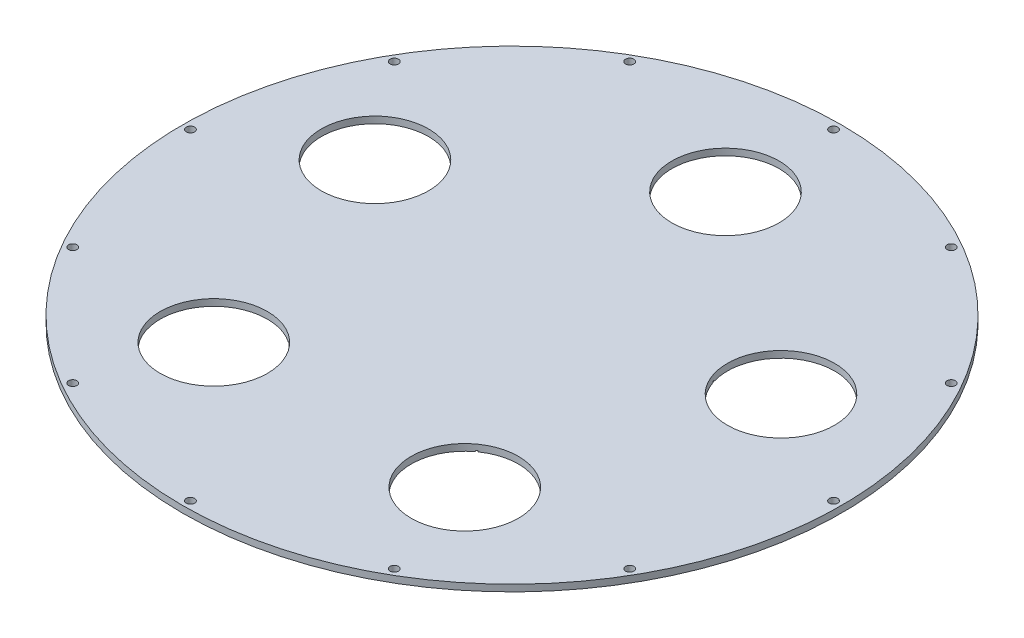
ISO-10303-21;
HEADER;
FILE_DESCRIPTION(('STEP AP214'),'2;1');
FILE_NAME('part.step','',(''),(''),'','','');
FILE_SCHEMA(('AUTOMOTIVE_DESIGN { 1 0 10303 214 1 1 1 1 }'));
ENDSEC;
DATA;
#1=APPLICATION_CONTEXT('core data for automotive mechanical design processes');
#2=APPLICATION_PROTOCOL_DEFINITION('international standard','automotive_design',2000,#1);
#3=PRODUCT_CONTEXT('',#1,'mechanical');
#4=PRODUCT('Part','Part','',(#3));
#5=PRODUCT_RELATED_PRODUCT_CATEGORY('part','',(#4));
#6=PRODUCT_DEFINITION_FORMATION('','',#4);
#7=PRODUCT_DEFINITION_CONTEXT('part definition',#1,'design');
#8=PRODUCT_DEFINITION('design','',#6,#7);
#9=PRODUCT_DEFINITION_SHAPE('','',#8);
#10=(LENGTH_UNIT() NAMED_UNIT(*) SI_UNIT(.MILLI.,.METRE.));
#11=(NAMED_UNIT(*) PLANE_ANGLE_UNIT() SI_UNIT($,.RADIAN.));
#12=(NAMED_UNIT(*) SI_UNIT($,.STERADIAN.) SOLID_ANGLE_UNIT());
#13=UNCERTAINTY_MEASURE_WITH_UNIT(LENGTH_MEASURE(1.E-05),#10,'distance_accuracy_value','');
#14=(GEOMETRIC_REPRESENTATION_CONTEXT(3) GLOBAL_UNCERTAINTY_ASSIGNED_CONTEXT((#13)) GLOBAL_UNIT_ASSIGNED_CONTEXT((#10,
#11,#12)) REPRESENTATION_CONTEXT('',''));
#15=CARTESIAN_POINT('',(0.,0.,0.));
#16=DIRECTION('',(0.,0.,1.));
#17=DIRECTION('',(1.,0.,0.));
#18=AXIS2_PLACEMENT_3D('',#15,#16,#17);
#19=CARTESIAN_POINT('',(0.,9.525,0.));
#20=DIRECTION('',(0.,-1.,0.));
#21=DIRECTION('',(0.,0.,-1.));
#22=AXIS2_PLACEMENT_3D('',#19,#20,#21);
#23=CYLINDRICAL_SURFACE('',#22,156.845);
#24=CARTESIAN_POINT('',(0.,9.525,0.));
#25=DIRECTION('',(0.,1.,0.));
#26=DIRECTION('',(0.,0.,1.));
#27=AXIS2_PLACEMENT_3D('',#24,#25,#26);
#28=CIRCLE('',#27,156.845);
#29=CARTESIAN_POINT('',(0.,9.525,156.845));
#30=VERTEX_POINT('',#29);
#31=EDGE_CURVE('E261',#30,#30,#28,.T.);
#32=ORIENTED_EDGE('',*,*,#31,.F.);
#33=EDGE_LOOP('',(#32));
#34=FACE_BOUND('',#33,.T.);
#35=CARTESIAN_POINT('',(0.,6.35,0.));
#36=DIRECTION('',(0.,1.,0.));
#37=DIRECTION('',(0.,0.,1.));
#38=AXIS2_PLACEMENT_3D('',#35,#36,#37);
#39=CIRCLE('',#38,156.845);
#40=CARTESIAN_POINT('',(0.,6.35,156.845));
#41=VERTEX_POINT('',#40);
#42=EDGE_CURVE('E1113',#41,#41,#39,.T.);
#43=ORIENTED_EDGE('',*,*,#42,.T.);
#44=EDGE_LOOP('',(#43));
#45=FACE_BOUND('',#44,.T.);
#46=ADVANCED_FACE('F252',(#34,#45),#23,.T.);
#47=CARTESIAN_POINT('',(0.,9.525,153.035));
#48=DIRECTION('',(0.,-1.,0.));
#49=DIRECTION('',(0.,0.,-1.));
#50=AXIS2_PLACEMENT_3D('',#47,#48,#49);
#51=CYLINDRICAL_SURFACE('',#50,2.);
#52=CARTESIAN_POINT('',(0.,9.525,153.035));
#53=DIRECTION('',(0.,1.,0.));
#54=DIRECTION('',(0.,0.,1.));
#55=AXIS2_PLACEMENT_3D('',#52,#53,#54);
#56=CIRCLE('',#55,2.);
#57=CARTESIAN_POINT('',(0.,9.525,155.035));
#58=VERTEX_POINT('',#57);
#59=EDGE_CURVE('E1062',#58,#58,#56,.T.);
#60=ORIENTED_EDGE('',*,*,#59,.T.);
#61=EDGE_LOOP('',(#60));
#62=FACE_BOUND('',#61,.T.);
#63=CARTESIAN_POINT('',(0.,6.35,153.035));
#64=DIRECTION('',(0.,1.,0.));
#65=DIRECTION('',(0.,0.,1.));
#66=AXIS2_PLACEMENT_3D('',#63,#64,#65);
#67=CIRCLE('',#66,2.);
#68=CARTESIAN_POINT('',(0.,6.35,155.035));
#69=VERTEX_POINT('',#68);
#70=EDGE_CURVE('E1111',#69,#69,#67,.T.);
#71=ORIENTED_EDGE('',*,*,#70,.F.);
#72=EDGE_LOOP('',(#71));
#73=FACE_BOUND('',#72,.T.);
#74=ADVANCED_FACE('F1156',(#62,#73),#51,.F.);
#75=CARTESIAN_POINT('',(-76.5175,9.525,132.532197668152));
#76=DIRECTION('',(0.,-1.,0.));
#77=DIRECTION('',(0.,0.,-1.));
#78=AXIS2_PLACEMENT_3D('',#75,#76,#77);
#79=CYLINDRICAL_SURFACE('',#78,2.);
#80=CARTESIAN_POINT('',(-76.5175,9.525,132.532197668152));
#81=DIRECTION('',(0.,1.,0.));
#82=DIRECTION('',(0.,0.,1.));
#83=AXIS2_PLACEMENT_3D('',#80,#81,#82);
#84=CIRCLE('',#83,2.);
#85=CARTESIAN_POINT('',(-76.5175,9.525,134.532197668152));
#86=VERTEX_POINT('',#85);
#87=EDGE_CURVE('E1059',#86,#86,#84,.T.);
#88=ORIENTED_EDGE('',*,*,#87,.T.);
#89=EDGE_LOOP('',(#88));
#90=FACE_BOUND('',#89,.T.);
#91=CARTESIAN_POINT('',(-76.5175,6.35,132.532197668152));
#92=DIRECTION('',(0.,1.,0.));
#93=DIRECTION('',(0.,0.,1.));
#94=AXIS2_PLACEMENT_3D('',#91,#92,#93);
#95=CIRCLE('',#94,2.);
#96=CARTESIAN_POINT('',(-76.5175,6.35,134.532197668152));
#97=VERTEX_POINT('',#96);
#98=EDGE_CURVE('E1108',#97,#97,#95,.T.);
#99=ORIENTED_EDGE('',*,*,#98,.F.);
#100=EDGE_LOOP('',(#99));
#101=FACE_BOUND('',#100,.T.);
#102=ADVANCED_FACE('F1162',(#90,#101),#79,.F.);
#103=CARTESIAN_POINT('',(-132.532197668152,9.525,76.5175));
#104=DIRECTION('',(0.,-1.,0.));
#105=DIRECTION('',(0.,0.,-1.));
#106=AXIS2_PLACEMENT_3D('',#103,#104,#105);
#107=CYLINDRICAL_SURFACE('',#106,2.);
#108=CARTESIAN_POINT('',(-132.532197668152,9.525,76.5175));
#109=DIRECTION('',(0.,1.,0.));
#110=DIRECTION('',(0.,0.,1.));
#111=AXIS2_PLACEMENT_3D('',#108,#109,#110);
#112=CIRCLE('',#111,2.);
#113=CARTESIAN_POINT('',(-132.532197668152,9.525,78.5175));
#114=VERTEX_POINT('',#113);
#115=EDGE_CURVE('E1056',#114,#114,#112,.T.);
#116=ORIENTED_EDGE('',*,*,#115,.T.);
#117=EDGE_LOOP('',(#116));
#118=FACE_BOUND('',#117,.T.);
#119=CARTESIAN_POINT('',(-132.532197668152,6.35,76.5175));
#120=DIRECTION('',(0.,1.,0.));
#121=DIRECTION('',(0.,0.,1.));
#122=AXIS2_PLACEMENT_3D('',#119,#120,#121);
#123=CIRCLE('',#122,2.);
#124=CARTESIAN_POINT('',(-132.532197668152,6.35,78.5175));
#125=VERTEX_POINT('',#124);
#126=EDGE_CURVE('E1105',#125,#125,#123,.T.);
#127=ORIENTED_EDGE('',*,*,#126,.F.);
#128=EDGE_LOOP('',(#127));
#129=FACE_BOUND('',#128,.T.);
#130=ADVANCED_FACE('F1171',(#118,#129),#107,.F.);
#131=CARTESIAN_POINT('',(-153.035,9.525,0.));
#132=DIRECTION('',(0.,-1.,0.));
#133=DIRECTION('',(0.,0.,-1.));
#134=AXIS2_PLACEMENT_3D('',#131,#132,#133);
#135=CYLINDRICAL_SURFACE('',#134,2.);
#136=CARTESIAN_POINT('',(-153.035,9.525,0.));
#137=DIRECTION('',(0.,1.,0.));
#138=DIRECTION('',(0.,0.,1.));
#139=AXIS2_PLACEMENT_3D('',#136,#137,#138);
#140=CIRCLE('',#139,2.);
#141=CARTESIAN_POINT('',(-153.035,9.525,1.99999999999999));
#142=VERTEX_POINT('',#141);
#143=EDGE_CURVE('E1053',#142,#142,#140,.T.);
#144=ORIENTED_EDGE('',*,*,#143,.T.);
#145=EDGE_LOOP('',(#144));
#146=FACE_BOUND('',#145,.T.);
#147=CARTESIAN_POINT('',(-153.035,6.35,0.));
#148=DIRECTION('',(0.,1.,0.));
#149=DIRECTION('',(0.,0.,1.));
#150=AXIS2_PLACEMENT_3D('',#147,#148,#149);
#151=CIRCLE('',#150,2.);
#152=CARTESIAN_POINT('',(-153.035,6.35,1.99999999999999));
#153=VERTEX_POINT('',#152);
#154=EDGE_CURVE('E1102',#153,#153,#151,.T.);
#155=ORIENTED_EDGE('',*,*,#154,.F.);
#156=EDGE_LOOP('',(#155));
#157=FACE_BOUND('',#156,.T.);
#158=ADVANCED_FACE('F1175',(#146,#157),#135,.F.);
#159=CARTESIAN_POINT('',(-132.532197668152,9.525,-76.5175));
#160=DIRECTION('',(0.,-1.,0.));
#161=DIRECTION('',(0.,0.,-1.));
#162=AXIS2_PLACEMENT_3D('',#159,#160,#161);
#163=CYLINDRICAL_SURFACE('',#162,2.);
#164=CARTESIAN_POINT('',(-132.532197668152,9.525,-76.5175));
#165=DIRECTION('',(0.,1.,0.));
#166=DIRECTION('',(0.,0.,1.));
#167=AXIS2_PLACEMENT_3D('',#164,#165,#166);
#168=CIRCLE('',#167,2.);
#169=CARTESIAN_POINT('',(-132.532197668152,9.525,-74.5175));
#170=VERTEX_POINT('',#169);
#171=EDGE_CURVE('E1050',#170,#170,#168,.T.);
#172=ORIENTED_EDGE('',*,*,#171,.T.);
#173=EDGE_LOOP('',(#172));
#174=FACE_BOUND('',#173,.T.);
#175=CARTESIAN_POINT('',(-132.532197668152,6.35,-76.5175));
#176=DIRECTION('',(0.,1.,0.));
#177=DIRECTION('',(0.,0.,1.));
#178=AXIS2_PLACEMENT_3D('',#175,#176,#177);
#179=CIRCLE('',#178,2.);
#180=CARTESIAN_POINT('',(-132.532197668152,6.35,-74.5175));
#181=VERTEX_POINT('',#180);
#182=EDGE_CURVE('E1099',#181,#181,#179,.T.);
#183=ORIENTED_EDGE('',*,*,#182,.F.);
#184=EDGE_LOOP('',(#183));
#185=FACE_BOUND('',#184,.T.);
#186=ADVANCED_FACE('F1179',(#174,#185),#163,.F.);
#187=CARTESIAN_POINT('',(-76.5175,9.525,-132.532197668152));
#188=DIRECTION('',(0.,-1.,0.));
#189=DIRECTION('',(0.,0.,-1.));
#190=AXIS2_PLACEMENT_3D('',#187,#188,#189);
#191=CYLINDRICAL_SURFACE('',#190,2.);
#192=CARTESIAN_POINT('',(-76.5175,9.525,-132.532197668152));
#193=DIRECTION('',(0.,1.,0.));
#194=DIRECTION('',(0.,0.,1.));
#195=AXIS2_PLACEMENT_3D('',#192,#193,#194);
#196=CIRCLE('',#195,2.);
#197=CARTESIAN_POINT('',(-76.5175,9.525,-130.532197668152));
#198=VERTEX_POINT('',#197);
#199=EDGE_CURVE('E1047',#198,#198,#196,.T.);
#200=ORIENTED_EDGE('',*,*,#199,.T.);
#201=EDGE_LOOP('',(#200));
#202=FACE_BOUND('',#201,.T.);
#203=CARTESIAN_POINT('',(-76.5175,6.35,-132.532197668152));
#204=DIRECTION('',(0.,1.,0.));
#205=DIRECTION('',(0.,0.,1.));
#206=AXIS2_PLACEMENT_3D('',#203,#204,#205);
#207=CIRCLE('',#206,2.);
#208=CARTESIAN_POINT('',(-76.5175,6.35,-130.532197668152));
#209=VERTEX_POINT('',#208);
#210=EDGE_CURVE('E1096',#209,#209,#207,.T.);
#211=ORIENTED_EDGE('',*,*,#210,.F.);
#212=EDGE_LOOP('',(#211));
#213=FACE_BOUND('',#212,.T.);
#214=ADVANCED_FACE('F1183',(#202,#213),#191,.F.);
#215=CARTESIAN_POINT('',(0.,9.525,-153.035));
#216=DIRECTION('',(0.,-1.,0.));
#217=DIRECTION('',(0.,0.,-1.));
#218=AXIS2_PLACEMENT_3D('',#215,#216,#217);
#219=CYLINDRICAL_SURFACE('',#218,2.);
#220=CARTESIAN_POINT('',(0.,9.525,-153.035));
#221=DIRECTION('',(0.,1.,0.));
#222=DIRECTION('',(0.,0.,1.));
#223=AXIS2_PLACEMENT_3D('',#220,#221,#222);
#224=CIRCLE('',#223,2.);
#225=CARTESIAN_POINT('',(0.,9.525,-151.035));
#226=VERTEX_POINT('',#225);
#227=EDGE_CURVE('E1044',#226,#226,#224,.T.);
#228=ORIENTED_EDGE('',*,*,#227,.T.);
#229=EDGE_LOOP('',(#228));
#230=FACE_BOUND('',#229,.T.);
#231=CARTESIAN_POINT('',(0.,6.35,-153.035));
#232=DIRECTION('',(0.,1.,0.));
#233=DIRECTION('',(0.,0.,1.));
#234=AXIS2_PLACEMENT_3D('',#231,#232,#233);
#235=CIRCLE('',#234,2.);
#236=CARTESIAN_POINT('',(0.,6.35,-151.035));
#237=VERTEX_POINT('',#236);
#238=EDGE_CURVE('E1093',#237,#237,#235,.T.);
#239=ORIENTED_EDGE('',*,*,#238,.F.);
#240=EDGE_LOOP('',(#239));
#241=FACE_BOUND('',#240,.T.);
#242=ADVANCED_FACE('F1187',(#230,#241),#219,.F.);
#243=CARTESIAN_POINT('',(76.5175,9.525,-132.532197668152));
#244=DIRECTION('',(0.,-1.,0.));
#245=DIRECTION('',(0.,0.,-1.));
#246=AXIS2_PLACEMENT_3D('',#243,#244,#245);
#247=CYLINDRICAL_SURFACE('',#246,2.);
#248=CARTESIAN_POINT('',(76.5175,9.525,-132.532197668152));
#249=DIRECTION('',(0.,1.,0.));
#250=DIRECTION('',(0.,0.,1.));
#251=AXIS2_PLACEMENT_3D('',#248,#249,#250);
#252=CIRCLE('',#251,2.);
#253=CARTESIAN_POINT('',(76.5175,9.525,-130.532197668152));
#254=VERTEX_POINT('',#253);
#255=EDGE_CURVE('E1041',#254,#254,#252,.T.);
#256=ORIENTED_EDGE('',*,*,#255,.T.);
#257=EDGE_LOOP('',(#256));
#258=FACE_BOUND('',#257,.T.);
#259=CARTESIAN_POINT('',(76.5175,6.35,-132.532197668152));
#260=DIRECTION('',(0.,1.,0.));
#261=DIRECTION('',(0.,0.,1.));
#262=AXIS2_PLACEMENT_3D('',#259,#260,#261);
#263=CIRCLE('',#262,2.);
#264=CARTESIAN_POINT('',(76.5175,6.35,-130.532197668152));
#265=VERTEX_POINT('',#264);
#266=EDGE_CURVE('E1090',#265,#265,#263,.T.);
#267=ORIENTED_EDGE('',*,*,#266,.F.);
#268=EDGE_LOOP('',(#267));
#269=FACE_BOUND('',#268,.T.);
#270=ADVANCED_FACE('F1191',(#258,#269),#247,.F.);
#271=CARTESIAN_POINT('',(132.532197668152,9.525,-76.5175));
#272=DIRECTION('',(0.,-1.,0.));
#273=DIRECTION('',(0.,0.,-1.));
#274=AXIS2_PLACEMENT_3D('',#271,#272,#273);
#275=CYLINDRICAL_SURFACE('',#274,2.);
#276=CARTESIAN_POINT('',(132.532197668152,9.525,-76.5175));
#277=DIRECTION('',(0.,1.,0.));
#278=DIRECTION('',(0.,0.,1.));
#279=AXIS2_PLACEMENT_3D('',#276,#277,#278);
#280=CIRCLE('',#279,2.);
#281=CARTESIAN_POINT('',(132.532197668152,9.525,-74.5175));
#282=VERTEX_POINT('',#281);
#283=EDGE_CURVE('E1038',#282,#282,#280,.T.);
#284=ORIENTED_EDGE('',*,*,#283,.T.);
#285=EDGE_LOOP('',(#284));
#286=FACE_BOUND('',#285,.T.);
#287=CARTESIAN_POINT('',(132.532197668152,6.35,-76.5175));
#288=DIRECTION('',(0.,1.,0.));
#289=DIRECTION('',(0.,0.,1.));
#290=AXIS2_PLACEMENT_3D('',#287,#288,#289);
#291=CIRCLE('',#290,2.);
#292=CARTESIAN_POINT('',(132.532197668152,6.35,-74.5175));
#293=VERTEX_POINT('',#292);
#294=EDGE_CURVE('E1087',#293,#293,#291,.T.);
#295=ORIENTED_EDGE('',*,*,#294,.F.);
#296=EDGE_LOOP('',(#295));
#297=FACE_BOUND('',#296,.T.);
#298=ADVANCED_FACE('F1195',(#286,#297),#275,.F.);
#299=CARTESIAN_POINT('',(153.035,9.525,0.));
#300=DIRECTION('',(0.,-1.,0.));
#301=DIRECTION('',(0.,0.,-1.));
#302=AXIS2_PLACEMENT_3D('',#299,#300,#301);
#303=CYLINDRICAL_SURFACE('',#302,2.);
#304=CARTESIAN_POINT('',(153.035,9.525,0.));
#305=DIRECTION('',(0.,1.,0.));
#306=DIRECTION('',(0.,0.,1.));
#307=AXIS2_PLACEMENT_3D('',#304,#305,#306);
#308=CIRCLE('',#307,2.);
#309=CARTESIAN_POINT('',(153.035,9.525,1.99999999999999));
#310=VERTEX_POINT('',#309);
#311=EDGE_CURVE('E1035',#310,#310,#308,.T.);
#312=ORIENTED_EDGE('',*,*,#311,.T.);
#313=EDGE_LOOP('',(#312));
#314=FACE_BOUND('',#313,.T.);
#315=CARTESIAN_POINT('',(153.035,6.35,0.));
#316=DIRECTION('',(0.,1.,0.));
#317=DIRECTION('',(0.,0.,1.));
#318=AXIS2_PLACEMENT_3D('',#315,#316,#317);
#319=CIRCLE('',#318,2.);
#320=CARTESIAN_POINT('',(153.035,6.35,1.99999999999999));
#321=VERTEX_POINT('',#320);
#322=EDGE_CURVE('E1084',#321,#321,#319,.T.);
#323=ORIENTED_EDGE('',*,*,#322,.F.);
#324=EDGE_LOOP('',(#323));
#325=FACE_BOUND('',#324,.T.);
#326=ADVANCED_FACE('F1199',(#314,#325),#303,.F.);
#327=CARTESIAN_POINT('',(132.532197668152,9.525,76.5174999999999));
#328=DIRECTION('',(0.,-1.,0.));
#329=DIRECTION('',(0.,0.,-1.));
#330=AXIS2_PLACEMENT_3D('',#327,#328,#329);
#331=CYLINDRICAL_SURFACE('',#330,2.);
#332=CARTESIAN_POINT('',(132.532197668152,9.525,76.5174999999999));
#333=DIRECTION('',(0.,1.,0.));
#334=DIRECTION('',(0.,0.,1.));
#335=AXIS2_PLACEMENT_3D('',#332,#333,#334);
#336=CIRCLE('',#335,2.);
#337=CARTESIAN_POINT('',(132.532197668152,9.525,78.5174999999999));
#338=VERTEX_POINT('',#337);
#339=EDGE_CURVE('E1032',#338,#338,#336,.T.);
#340=ORIENTED_EDGE('',*,*,#339,.T.);
#341=EDGE_LOOP('',(#340));
#342=FACE_BOUND('',#341,.T.);
#343=CARTESIAN_POINT('',(132.532197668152,6.35,76.5174999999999));
#344=DIRECTION('',(0.,1.,0.));
#345=DIRECTION('',(0.,0.,1.));
#346=AXIS2_PLACEMENT_3D('',#343,#344,#345);
#347=CIRCLE('',#346,2.);
#348=CARTESIAN_POINT('',(132.532197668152,6.35,78.5174999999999));
#349=VERTEX_POINT('',#348);
#350=EDGE_CURVE('E1081',#349,#349,#347,.T.);
#351=ORIENTED_EDGE('',*,*,#350,.F.);
#352=EDGE_LOOP('',(#351));
#353=FACE_BOUND('',#352,.T.);
#354=ADVANCED_FACE('F1203',(#342,#353),#331,.F.);
#355=CARTESIAN_POINT('',(76.5175,9.525,132.532197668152));
#356=DIRECTION('',(0.,-1.,0.));
#357=DIRECTION('',(0.,0.,-1.));
#358=AXIS2_PLACEMENT_3D('',#355,#356,#357);
#359=CYLINDRICAL_SURFACE('',#358,2.);
#360=CARTESIAN_POINT('',(76.5175,9.525,132.532197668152));
#361=DIRECTION('',(0.,1.,0.));
#362=DIRECTION('',(0.,0.,1.));
#363=AXIS2_PLACEMENT_3D('',#360,#361,#362);
#364=CIRCLE('',#363,2.);
#365=CARTESIAN_POINT('',(76.5175,9.525,134.532197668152));
#366=VERTEX_POINT('',#365);
#367=EDGE_CURVE('E1029',#366,#366,#364,.T.);
#368=ORIENTED_EDGE('',*,*,#367,.T.);
#369=EDGE_LOOP('',(#368));
#370=FACE_BOUND('',#369,.T.);
#371=CARTESIAN_POINT('',(76.5175,6.35,132.532197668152));
#372=DIRECTION('',(0.,1.,0.));
#373=DIRECTION('',(0.,0.,1.));
#374=AXIS2_PLACEMENT_3D('',#371,#372,#373);
#375=CIRCLE('',#374,2.);
#376=CARTESIAN_POINT('',(76.5175,6.35,134.532197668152));
#377=VERTEX_POINT('',#376);
#378=EDGE_CURVE('E1078',#377,#377,#375,.T.);
#379=ORIENTED_EDGE('',*,*,#378,.F.);
#380=EDGE_LOOP('',(#379));
#381=FACE_BOUND('',#380,.T.);
#382=ADVANCED_FACE('F1207',(#370,#381),#359,.F.);
#383=CARTESIAN_POINT('',(59.7189816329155,9.525,82.1961266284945));
#384=DIRECTION('',(0.,-1.,0.));
#385=DIRECTION('',(0.,0.,-1.));
#386=AXIS2_PLACEMENT_3D('',#383,#384,#385);
#387=CYLINDRICAL_SURFACE('',#386,25.527);
#388=DIRECTION('',(0.,-1.,0.));
#389=VECTOR('',#388,1.);
#390=CARTESIAN_POINT('',(44.3572543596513,6.858,61.8087515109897));
#391=LINE('',#390,#389);
#392=CARTESIAN_POINT('',(44.3572543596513,6.858,61.8087515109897));
#393=VERTEX_POINT('',#392);
#394=CARTESIAN_POINT('',(44.3572543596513,6.35,61.8087515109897));
#395=VERTEX_POINT('',#394);
#396=EDGE_CURVE('E900',#393,#395,#391,.T.);
#397=ORIENTED_EDGE('',*,*,#396,.F.);
#398=CARTESIAN_POINT('',(59.7189816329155,6.858,82.1961266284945));
#399=DIRECTION('',(0.,-1.,0.));
#400=DIRECTION('',(0.,0.,-1.));
#401=AXIS2_PLACEMENT_3D('',#398,#399,#400);
#402=CIRCLE('',#401,25.527);
#403=CARTESIAN_POINT('',(45.0764704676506,6.858,61.2862104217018));
#404=VERTEX_POINT('',#403);
#405=EDGE_CURVE('E886',#404,#393,#402,.F.);
#406=ORIENTED_EDGE('',*,*,#405,.F.);
#407=DIRECTION('',(0.,-1.,0.));
#408=VECTOR('',#407,1.);
#409=CARTESIAN_POINT('',(45.0764704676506,6.858,61.2862104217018));
#410=LINE('',#409,#408);
#411=CARTESIAN_POINT('',(45.0764704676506,6.35,61.2862104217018));
#412=VERTEX_POINT('',#411);
#413=EDGE_CURVE('E903',#404,#412,#410,.T.);
#414=ORIENTED_EDGE('',*,*,#413,.T.);
#415=CARTESIAN_POINT('',(59.7189816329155,6.35,82.1961266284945));
#416=DIRECTION('',(0.,1.,0.));
#417=DIRECTION('',(0.,0.,1.));
#418=AXIS2_PLACEMENT_3D('',#415,#416,#417);
#419=CIRCLE('',#418,25.527);
#420=EDGE_CURVE('E1075',#395,#412,#419,.T.);
#421=ORIENTED_EDGE('',*,*,#420,.F.);
#422=EDGE_LOOP('',(#397,#406,#414,#421));
#423=FACE_BOUND('',#422,.T.);
#424=CARTESIAN_POINT('',(59.7189816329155,9.525,82.1961266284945));
#425=DIRECTION('',(0.,1.,0.));
#426=DIRECTION('',(0.,0.,1.));
#427=AXIS2_PLACEMENT_3D('',#424,#425,#426);
#428=CIRCLE('',#427,25.527);
#429=CARTESIAN_POINT('',(59.7189816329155,9.525,107.723126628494));
#430=VERTEX_POINT('',#429);
#431=EDGE_CURVE('E1026',#430,#430,#428,.T.);
#432=ORIENTED_EDGE('',*,*,#431,.T.);
#433=EDGE_LOOP('',(#432));
#434=FACE_BOUND('',#433,.T.);
#435=ADVANCED_FACE('F1211',(#423,#434),#387,.F.);
#436=CARTESIAN_POINT('',(96.6273420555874,9.525,-31.3961266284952));
#437=DIRECTION('',(0.,-1.,0.));
#438=DIRECTION('',(0.,0.,-1.));
#439=AXIS2_PLACEMENT_3D('',#436,#437,#438);
#440=CYLINDRICAL_SURFACE('',#439,25.527);
#441=DIRECTION('',(0.,-1.,0.));
#442=VECTOR('',#441,1.);
#443=CARTESIAN_POINT('',(72.4907613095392,6.858,-23.0863011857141));
#444=LINE('',#443,#442);
#445=CARTESIAN_POINT('',(72.4907613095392,6.858,-23.0863011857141));
#446=VERTEX_POINT('',#445);
#447=CARTESIAN_POINT('',(72.4907613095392,6.35,-23.0863011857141));
#448=VERTEX_POINT('',#447);
#449=EDGE_CURVE('E965',#446,#448,#444,.T.);
#450=ORIENTED_EDGE('',*,*,#449,.F.);
#451=CARTESIAN_POINT('',(96.6273420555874,6.858,-31.3961266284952));
#452=DIRECTION('',(0.,-1.,0.));
#453=DIRECTION('',(0.,0.,-1.));
#454=AXIS2_PLACEMENT_3D('',#451,#452,#453);
#455=CIRCLE('',#454,25.527);
#456=CARTESIAN_POINT('',(72.2160452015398,6.858,-23.9317904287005));
#457=VERTEX_POINT('',#456);
#458=EDGE_CURVE('E995',#457,#446,#455,.F.);
#459=ORIENTED_EDGE('',*,*,#458,.F.);
#460=DIRECTION('',(0.,-1.,0.));
#461=VECTOR('',#460,1.);
#462=CARTESIAN_POINT('',(72.2160452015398,6.858,-23.9317904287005));
#463=LINE('',#462,#461);
#464=CARTESIAN_POINT('',(72.2160452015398,6.35,-23.9317904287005));
#465=VERTEX_POINT('',#464);
#466=EDGE_CURVE('E1008',#457,#465,#463,.T.);
#467=ORIENTED_EDGE('',*,*,#466,.T.);
#468=CARTESIAN_POINT('',(96.6273420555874,6.35,-31.3961266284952));
#469=DIRECTION('',(0.,1.,0.));
#470=DIRECTION('',(0.,0.,1.));
#471=AXIS2_PLACEMENT_3D('',#468,#469,#470);
#472=CIRCLE('',#471,25.527);
#473=EDGE_CURVE('E1072',#448,#465,#472,.T.);
#474=ORIENTED_EDGE('',*,*,#473,.F.);
#475=EDGE_LOOP('',(#450,#459,#467,#474));
#476=FACE_BOUND('',#475,.T.);
#477=CARTESIAN_POINT('',(96.6273420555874,9.525,-31.3961266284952));
#478=DIRECTION('',(0.,1.,0.));
#479=DIRECTION('',(0.,0.,1.));
#480=AXIS2_PLACEMENT_3D('',#477,#478,#479);
#481=CIRCLE('',#480,25.527);
#482=CARTESIAN_POINT('',(96.6273420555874,9.525,-5.8691266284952));
#483=VERTEX_POINT('',#482);
#484=EDGE_CURVE('E1023',#483,#483,#481,.T.);
#485=ORIENTED_EDGE('',*,*,#484,.T.);
#486=EDGE_LOOP('',(#485));
#487=FACE_BOUND('',#486,.T.);
#488=ADVANCED_FACE('F1215',(#476,#487),#440,.F.);
#489=CARTESIAN_POINT('',(0.,9.525,-101.6));
#490=DIRECTION('',(0.,-1.,0.));
#491=DIRECTION('',(0.,0.,-1.));
#492=AXIS2_PLACEMENT_3D('',#489,#490,#491);
#493=CYLINDRICAL_SURFACE('',#492,25.527);
#494=DIRECTION('',(0.,-1.,0.));
#495=VECTOR('',#494,1.);
#496=CARTESIAN_POINT('',(0.444500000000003,6.858,-76.076870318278));
#497=LINE('',#496,#495);
#498=CARTESIAN_POINT('',(0.444500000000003,6.858,-76.076870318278));
#499=VERTEX_POINT('',#498);
#500=CARTESIAN_POINT('',(0.444500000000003,6.35,-76.076870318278));
#501=VERTEX_POINT('',#500);
#502=EDGE_CURVE('E893',#499,#501,#497,.T.);
#503=ORIENTED_EDGE('',*,*,#502,.F.);
#504=CARTESIAN_POINT('',(0.,6.858,-101.6));
#505=DIRECTION('',(0.,-1.,0.));
#506=DIRECTION('',(0.,0.,-1.));
#507=AXIS2_PLACEMENT_3D('',#504,#505,#506);
#508=CIRCLE('',#507,25.527);
#509=CARTESIAN_POINT('',(-0.444500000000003,6.858,-76.076870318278));
#510=VERTEX_POINT('',#509);
#511=EDGE_CURVE('E925',#510,#499,#508,.F.);
#512=ORIENTED_EDGE('',*,*,#511,.F.);
#513=DIRECTION('',(0.,-1.,0.));
#514=VECTOR('',#513,1.);
#515=CARTESIAN_POINT('',(-0.444500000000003,6.858,-76.076870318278));
#516=LINE('',#515,#514);
#517=CARTESIAN_POINT('',(-0.444500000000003,6.35,-76.076870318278));
#518=VERTEX_POINT('',#517);
#519=EDGE_CURVE('E938',#510,#518,#516,.T.);
#520=ORIENTED_EDGE('',*,*,#519,.T.);
#521=CARTESIAN_POINT('',(0.,6.35,-101.6));
#522=DIRECTION('',(0.,1.,0.));
#523=DIRECTION('',(0.,0.,1.));
#524=AXIS2_PLACEMENT_3D('',#521,#522,#523);
#525=CIRCLE('',#524,25.527);
#526=EDGE_CURVE('E1069',#501,#518,#525,.T.);
#527=ORIENTED_EDGE('',*,*,#526,.F.);
#528=EDGE_LOOP('',(#503,#512,#520,#527));
#529=FACE_BOUND('',#528,.T.);
#530=CARTESIAN_POINT('',(0.,9.525,-101.6));
#531=DIRECTION('',(0.,1.,0.));
#532=DIRECTION('',(0.,0.,1.));
#533=AXIS2_PLACEMENT_3D('',#530,#531,#532);
#534=CIRCLE('',#533,25.527);
#535=CARTESIAN_POINT('',(0.,9.525,-76.073));
#536=VERTEX_POINT('',#535);
#537=EDGE_CURVE('E1020',#536,#536,#534,.T.);
#538=ORIENTED_EDGE('',*,*,#537,.T.);
#539=EDGE_LOOP('',(#538));
#540=FACE_BOUND('',#539,.T.);
#541=ADVANCED_FACE('F1218',(#529,#540),#493,.F.);
#542=CARTESIAN_POINT('',(-96.6273420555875,9.525,-31.3961266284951));
#543=DIRECTION('',(0.,-1.,0.));
#544=DIRECTION('',(0.,0.,-1.));
#545=AXIS2_PLACEMENT_3D('',#542,#543,#544);
#546=CYLINDRICAL_SURFACE('',#545,25.527);
#547=DIRECTION('',(0.,-1.,0.));
#548=VECTOR('',#547,1.);
#549=CARTESIAN_POINT('',(-72.2160452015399,6.858,-23.9317904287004));
#550=LINE('',#549,#548);
#551=CARTESIAN_POINT('',(-72.2160452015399,6.858,-23.9317904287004));
#552=VERTEX_POINT('',#551);
#553=CARTESIAN_POINT('',(-72.2160452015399,6.35,-23.9317904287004));
#554=VERTEX_POINT('',#553);
#555=EDGE_CURVE('E643',#552,#554,#550,.T.);
#556=ORIENTED_EDGE('',*,*,#555,.F.);
#557=CARTESIAN_POINT('',(-96.6273420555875,6.858,-31.3961266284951));
#558=DIRECTION('',(0.,-1.,0.));
#559=DIRECTION('',(0.,0.,-1.));
#560=AXIS2_PLACEMENT_3D('',#557,#558,#559);
#561=CIRCLE('',#560,25.527);
#562=CARTESIAN_POINT('',(-72.4907613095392,6.858,-23.086301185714));
#563=VERTEX_POINT('',#562);
#564=EDGE_CURVE('E622',#563,#552,#561,.F.);
#565=ORIENTED_EDGE('',*,*,#564,.F.);
#566=DIRECTION('',(0.,-1.,0.));
#567=VECTOR('',#566,1.);
#568=CARTESIAN_POINT('',(-72.4907613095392,6.858,-23.086301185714));
#569=LINE('',#568,#567);
#570=CARTESIAN_POINT('',(-72.4907613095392,6.35,-23.086301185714));
#571=VERTEX_POINT('',#570);
#572=EDGE_CURVE('E608',#563,#571,#569,.T.);
#573=ORIENTED_EDGE('',*,*,#572,.T.);
#574=CARTESIAN_POINT('',(-96.6273420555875,6.35,-31.3961266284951));
#575=DIRECTION('',(0.,1.,0.));
#576=DIRECTION('',(0.,0.,1.));
#577=AXIS2_PLACEMENT_3D('',#574,#575,#576);
#578=CIRCLE('',#577,25.527);
#579=EDGE_CURVE('E640',#554,#571,#578,.T.);
#580=ORIENTED_EDGE('',*,*,#579,.F.);
#581=EDGE_LOOP('',(#556,#565,#573,#580));
#582=FACE_BOUND('',#581,.T.);
#583=CARTESIAN_POINT('',(-96.6273420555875,9.525,-31.3961266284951));
#584=DIRECTION('',(0.,1.,0.));
#585=DIRECTION('',(0.,0.,1.));
#586=AXIS2_PLACEMENT_3D('',#583,#584,#585);
#587=CIRCLE('',#586,25.527);
#588=CARTESIAN_POINT('',(-96.6273420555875,9.525,-5.86912662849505));
#589=VERTEX_POINT('',#588);
#590=EDGE_CURVE('E1017',#589,#589,#587,.T.);
#591=ORIENTED_EDGE('',*,*,#590,.T.);
#592=EDGE_LOOP('',(#591));
#593=FACE_BOUND('',#592,.T.);
#594=ADVANCED_FACE('F254',(#582,#593),#546,.F.);
#595=CARTESIAN_POINT('',(-59.718981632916,9.525,82.1961266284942));
#596=DIRECTION('',(0.,-1.,0.));
#597=DIRECTION('',(0.,0.,-1.));
#598=AXIS2_PLACEMENT_3D('',#595,#596,#597);
#599=CYLINDRICAL_SURFACE('',#598,25.527);
#600=DIRECTION('',(0.,-1.,0.));
#601=VECTOR('',#600,1.);
#602=CARTESIAN_POINT('',(-45.076470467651,6.858,61.2862104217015));
#603=LINE('',#602,#601);
#604=CARTESIAN_POINT('',(-45.076470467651,6.858,61.2862104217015));
#605=VERTEX_POINT('',#604);
#606=CARTESIAN_POINT('',(-45.076470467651,6.35,61.2862104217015));
#607=VERTEX_POINT('',#606);
#608=EDGE_CURVE('E973',#605,#607,#603,.T.);
#609=ORIENTED_EDGE('',*,*,#608,.F.);
#610=CARTESIAN_POINT('',(-59.718981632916,6.858,82.1961266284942));
#611=DIRECTION('',(0.,-1.,0.));
#612=DIRECTION('',(0.,0.,-1.));
#613=AXIS2_PLACEMENT_3D('',#610,#611,#612);
#614=CIRCLE('',#613,25.527);
#615=CARTESIAN_POINT('',(-44.3572543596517,6.858,61.8087515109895));
#616=VERTEX_POINT('',#615);
#617=EDGE_CURVE('E955',#616,#605,#614,.F.);
#618=ORIENTED_EDGE('',*,*,#617,.F.);
#619=DIRECTION('',(0.,-1.,0.));
#620=VECTOR('',#619,1.);
#621=CARTESIAN_POINT('',(-44.3572543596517,6.858,61.8087515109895));
#622=LINE('',#621,#620);
#623=CARTESIAN_POINT('',(-44.3572543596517,6.35,61.8087515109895));
#624=VERTEX_POINT('',#623);
#625=EDGE_CURVE('E975',#616,#624,#622,.T.);
#626=ORIENTED_EDGE('',*,*,#625,.T.);
#627=CARTESIAN_POINT('',(-59.718981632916,6.35,82.1961266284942));
#628=DIRECTION('',(0.,1.,0.));
#629=DIRECTION('',(0.,0.,1.));
#630=AXIS2_PLACEMENT_3D('',#627,#628,#629);
#631=CIRCLE('',#630,25.527);
#632=EDGE_CURVE('E256',#607,#624,#631,.T.);
#633=ORIENTED_EDGE('',*,*,#632,.F.);
#634=EDGE_LOOP('',(#609,#618,#626,#633));
#635=FACE_BOUND('',#634,.T.);
#636=CARTESIAN_POINT('',(-59.718981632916,9.525,82.1961266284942));
#637=DIRECTION('',(0.,1.,0.));
#638=DIRECTION('',(0.,0.,1.));
#639=AXIS2_PLACEMENT_3D('',#636,#637,#638);
#640=CIRCLE('',#639,25.527);
#641=CARTESIAN_POINT('',(-59.718981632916,9.525,107.723126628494));
#642=VERTEX_POINT('',#641);
#643=EDGE_CURVE('E12',#642,#642,#640,.T.);
#644=ORIENTED_EDGE('',*,*,#643,.T.);
#645=EDGE_LOOP('',(#644));
#646=FACE_BOUND('',#645,.T.);
#647=ADVANCED_FACE('F1125',(#635,#646),#599,.F.);
#648=CARTESIAN_POINT('',(0.,9.525,0.));
#649=DIRECTION('',(0.,1.,0.));
#650=DIRECTION('',(0.,0.,1.));
#651=AXIS2_PLACEMENT_3D('',#648,#649,#650);
#652=PLANE('',#651);
#653=ORIENTED_EDGE('',*,*,#590,.F.);
#654=EDGE_LOOP('',(#653));
#655=FACE_BOUND('',#654,.T.);
#656=ORIENTED_EDGE('',*,*,#537,.F.);
#657=EDGE_LOOP('',(#656));
#658=FACE_BOUND('',#657,.T.);
#659=ORIENTED_EDGE('',*,*,#484,.F.);
#660=EDGE_LOOP('',(#659));
#661=FACE_BOUND('',#660,.T.);
#662=ORIENTED_EDGE('',*,*,#431,.F.);
#663=EDGE_LOOP('',(#662));
#664=FACE_BOUND('',#663,.T.);
#665=ORIENTED_EDGE('',*,*,#367,.F.);
#666=EDGE_LOOP('',(#665));
#667=FACE_BOUND('',#666,.T.);
#668=ORIENTED_EDGE('',*,*,#339,.F.);
#669=EDGE_LOOP('',(#668));
#670=FACE_BOUND('',#669,.T.);
#671=ORIENTED_EDGE('',*,*,#311,.F.);
#672=EDGE_LOOP('',(#671));
#673=FACE_BOUND('',#672,.T.);
#674=ORIENTED_EDGE('',*,*,#283,.F.);
#675=EDGE_LOOP('',(#674));
#676=FACE_BOUND('',#675,.T.);
#677=ORIENTED_EDGE('',*,*,#255,.F.);
#678=EDGE_LOOP('',(#677));
#679=FACE_BOUND('',#678,.T.);
#680=ORIENTED_EDGE('',*,*,#227,.F.);
#681=EDGE_LOOP('',(#680));
#682=FACE_BOUND('',#681,.T.);
#683=ORIENTED_EDGE('',*,*,#199,.F.);
#684=EDGE_LOOP('',(#683));
#685=FACE_BOUND('',#684,.T.);
#686=ORIENTED_EDGE('',*,*,#171,.F.);
#687=EDGE_LOOP('',(#686));
#688=FACE_BOUND('',#687,.T.);
#689=ORIENTED_EDGE('',*,*,#143,.F.);
#690=EDGE_LOOP('',(#689));
#691=FACE_BOUND('',#690,.T.);
#692=ORIENTED_EDGE('',*,*,#115,.F.);
#693=EDGE_LOOP('',(#692));
#694=FACE_BOUND('',#693,.T.);
#695=ORIENTED_EDGE('',*,*,#87,.F.);
#696=EDGE_LOOP('',(#695));
#697=FACE_BOUND('',#696,.T.);
#698=ORIENTED_EDGE('',*,*,#59,.F.);
#699=EDGE_LOOP('',(#698));
#700=FACE_BOUND('',#699,.T.);
#701=ORIENTED_EDGE('',*,*,#31,.T.);
#702=EDGE_LOOP('',(#701));
#703=FACE_BOUND('',#702,.T.);
#704=ORIENTED_EDGE('',*,*,#643,.F.);
#705=EDGE_LOOP('',(#704));
#706=FACE_BOUND('',#705,.T.);
#707=ADVANCED_FACE('F1232',(#655,#658,#661,#664,#667,#670,#673,#676,#679,#682,#685,#688,#691,
#694,#697,#700,#703,#706),#652,.T.);
#708=CARTESIAN_POINT('',(0.,6.35,0.));
#709=DIRECTION('',(0.,1.,0.));
#710=DIRECTION('',(0.,0.,1.));
#711=AXIS2_PLACEMENT_3D('',#708,#709,#710);
#712=PLANE('',#711);
#713=DIRECTION('',(0.951056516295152,0.,0.309016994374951));
#714=VECTOR('',#713,1.);
#715=CARTESIAN_POINT('',(0.137358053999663,6.35,-0.422744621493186));
#716=LINE('',#715,#714);
#717=CARTESIAN_POINT('',(-48.1763129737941,6.35,-16.1208079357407));
#718=VERTEX_POINT('',#717);
#719=CARTESIAN_POINT('',(-0.444500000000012,6.35,-0.611801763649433));
#720=VERTEX_POINT('',#719);
#721=EDGE_CURVE('E727',#718,#720,#716,.T.);
#722=ORIENTED_EDGE('',*,*,#721,.F.);
#723=DIRECTION('',(-0.30901699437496,0.,0.951056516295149));
#724=VECTOR('',#723,1.);
#725=CARTESIAN_POINT('',(-48.3136710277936,6.35,-15.698063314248));
#726=LINE('',#725,#724);
#727=CARTESIAN_POINT('',(-47.5287678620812,6.35,-18.1137468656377));
#728=VERTEX_POINT('',#727);
#729=EDGE_CURVE('E277',#728,#718,#726,.T.);
#730=ORIENTED_EDGE('',*,*,#729,.F.);
#731=DIRECTION('',(0.978147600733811,0.,-0.207911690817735));
#732=VECTOR('',#731,1.);
#733=CARTESIAN_POINT('',(-5.73830123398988,6.35,-26.9965847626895));
#734=LINE('',#733,#732);
#735=CARTESIAN_POINT('',(-52.497757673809,6.35,-17.0575554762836));
#736=VERTEX_POINT('',#735);
#737=EDGE_CURVE('E650',#736,#728,#734,.T.);
#738=ORIENTED_EDGE('',*,*,#737,.F.);
#739=DIRECTION('',(-0.66913060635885,0.,-0.743144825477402));
#740=VECTOR('',#739,1.);
#741=CARTESIAN_POINT('',(-20.510577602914,6.35,18.4678070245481));
#742=LINE('',#741,#740);
#743=CARTESIAN_POINT('',(-49.098574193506,6.35,-13.2823797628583));
#744=VERTEX_POINT('',#743);
#745=EDGE_CURVE('E808',#744,#736,#742,.T.);
#746=ORIENTED_EDGE('',*,*,#745,.F.);
#747=DIRECTION('',(-0.30901699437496,0.,0.951056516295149));
#748=VECTOR('',#747,1.);
#749=CARTESIAN_POINT('',(-48.3136710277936,6.35,-15.698063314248));
#750=LINE('',#749,#748);
#751=CARTESIAN_POINT('',(-48.4510290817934,6.35,-15.2753186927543));
#752=VERTEX_POINT('',#751);
#753=EDGE_CURVE('E805',#752,#744,#750,.T.);
#754=ORIENTED_EDGE('',*,*,#753,.F.);
#755=DIRECTION('',(-0.951056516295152,0.,-0.309016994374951));
#756=VECTOR('',#755,1.);
#757=CARTESIAN_POINT('',(-0.137358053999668,6.35,0.4227446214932));
#758=LINE('',#757,#756);
#759=CARTESIAN_POINT('',(-0.719216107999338,6.35,0.233687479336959));
#760=VERTEX_POINT('',#759);
#761=EDGE_CURVE('E802',#760,#752,#758,.T.);
#762=ORIENTED_EDGE('',*,*,#761,.F.);
#763=DIRECTION('',(0.58778525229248,0.,-0.809016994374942));
#764=VECTOR('',#763,1.);
#765=CARTESIAN_POINT('',(-0.359608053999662,6.35,-0.261270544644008));
#766=LINE('',#765,#764);
#767=CARTESIAN_POINT('',(-30.2190988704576,6.35,40.8367927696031));
#768=VERTEX_POINT('',#767);
#769=EDGE_CURVE('E799',#768,#760,#766,.T.);
#770=ORIENTED_EDGE('',*,*,#769,.F.);
#771=DIRECTION('',(0.809016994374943,0.,0.58778525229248));
#772=VECTOR('',#771,1.);
#773=CARTESIAN_POINT('',(-29.859490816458,6.35,41.0980633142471));
#774=LINE('',#773,#772);
#775=CARTESIAN_POINT('',(-31.9143939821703,6.35,39.6050887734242));
#776=VERTEX_POINT('',#775);
#777=EDGE_CURVE('E796',#776,#768,#774,.T.);
#778=ORIENTED_EDGE('',*,*,#777,.F.);
#779=DIRECTION('',(0.104528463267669,0.,-0.994521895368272));
#780=VECTOR('',#779,1.);
#781=CARTESIAN_POINT('',(-27.448510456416,6.35,-2.88495470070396));
#782=LINE('',#781,#780);
#783=CARTESIAN_POINT('',(-32.4453985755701,6.35,44.6572600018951));
#784=VERTEX_POINT('',#783);
#785=EDGE_CURVE('E793',#784,#776,#782,.T.);
#786=ORIENTED_EDGE('',*,*,#785,.F.);
#787=DIRECTION('',(-0.913545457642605,0.,0.406736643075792));
#788=VECTOR('',#787,1.);
#789=CARTESIAN_POINT('',(11.2258111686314,6.35,25.2135847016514));
#790=LINE('',#789,#788);
#791=CARTESIAN_POINT('',(-27.8045876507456,6.35,42.59103785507));
#792=VERTEX_POINT('',#791);
#793=EDGE_CURVE('E790',#792,#784,#790,.T.);
#794=ORIENTED_EDGE('',*,*,#793,.F.);
#795=DIRECTION('',(0.809016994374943,0.,0.58778525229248));
#796=VECTOR('',#795,1.);
#797=CARTESIAN_POINT('',(-29.859490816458,6.35,41.0980633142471));
#798=LINE('',#797,#796);
#799=CARTESIAN_POINT('',(-29.4998827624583,6.35,41.3593338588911));
#800=VERTEX_POINT('',#799);
#801=EDGE_CURVE('E787',#800,#792,#798,.T.);
#802=ORIENTED_EDGE('',*,*,#801,.F.);
#803=DIRECTION('',(-0.58778525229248,0.,0.809016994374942));
#804=VECTOR('',#803,1.);
#805=CARTESIAN_POINT('',(0.359608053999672,6.35,0.261270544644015));
#806=LINE('',#805,#804);
#807=CARTESIAN_POINT('',(0.,6.35,0.756228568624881));
#808=VERTEX_POINT('',#807);
#809=EDGE_CURVE('E784',#808,#800,#806,.T.);
#810=ORIENTED_EDGE('',*,*,#809,.F.);
#811=DIRECTION('',(-0.587785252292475,0.,-0.809016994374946));
#812=VECTOR('',#811,1.);
#813=CARTESIAN_POINT('',(-0.35960805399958,6.35,0.261270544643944));
#814=LINE('',#813,#812);
#815=CARTESIAN_POINT('',(29.4998827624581,6.35,41.3593338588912));
#816=VERTEX_POINT('',#815);
#817=EDGE_CURVE('E781',#816,#808,#814,.T.);
#818=ORIENTED_EDGE('',*,*,#817,.F.);
#819=DIRECTION('',(-0.809016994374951,0.,0.587785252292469));
#820=VECTOR('',#819,1.);
#821=CARTESIAN_POINT('',(29.8594908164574,6.35,41.0980633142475));
#822=LINE('',#821,#820);
#823=CARTESIAN_POINT('',(27.8045876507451,6.35,42.5910378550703));
#824=VERTEX_POINT('',#823);
#825=EDGE_CURVE('E778',#816,#824,#822,.T.);
#826=ORIENTED_EDGE('',*,*,#825,.T.);
#827=DIRECTION('',(0.913545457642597,0.,0.406736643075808));
#828=VECTOR('',#827,1.);
#829=CARTESIAN_POINT('',(-11.2258111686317,6.35,25.2135847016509));
#830=LINE('',#829,#828);
#831=CARTESIAN_POINT('',(32.4453985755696,6.35,44.6572600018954));
#832=VERTEX_POINT('',#831);
#833=EDGE_CURVE('E775',#824,#832,#830,.T.);
#834=ORIENTED_EDGE('',*,*,#833,.T.);
#835=DIRECTION('',(-0.104528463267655,0.,-0.994521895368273));
#836=VECTOR('',#835,1.);
#837=CARTESIAN_POINT('',(27.4485104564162,6.35,-2.88495470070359));
#838=LINE('',#837,#836);
#839=CARTESIAN_POINT('',(31.9143939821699,6.35,39.6050887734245));
#840=VERTEX_POINT('',#839);
#841=EDGE_CURVE('E772',#832,#840,#838,.T.);
#842=ORIENTED_EDGE('',*,*,#841,.T.);
#843=DIRECTION('',(-0.809016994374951,0.,0.587785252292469));
#844=VECTOR('',#843,1.);
#845=CARTESIAN_POINT('',(29.8594908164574,6.35,41.0980633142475));
#846=LINE('',#845,#844);
#847=CARTESIAN_POINT('',(30.2190988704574,6.35,40.8367927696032));
#848=VERTEX_POINT('',#847);
#849=EDGE_CURVE('E769',#840,#848,#846,.T.);
#850=ORIENTED_EDGE('',*,*,#849,.T.);
#851=DIRECTION('',(0.587785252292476,0.,0.809016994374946));
#852=VECTOR('',#851,1.);
#853=CARTESIAN_POINT('',(0.35960805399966,6.35,-0.261270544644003));
#854=LINE('',#853,#852);
#855=CARTESIAN_POINT('',(0.719216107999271,6.35,0.23368747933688));
#856=VERTEX_POINT('',#855);
#857=EDGE_CURVE('E766',#856,#848,#854,.T.);
#858=ORIENTED_EDGE('',*,*,#857,.F.);
#859=DIRECTION('',(-0.951056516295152,0.,0.309016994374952));
#860=VECTOR('',#859,1.);
#861=CARTESIAN_POINT('',(0.137358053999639,6.35,0.422744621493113));
#862=LINE('',#861,#860);
#863=CARTESIAN_POINT('',(48.4510290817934,6.35,-15.2753186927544));
#864=VERTEX_POINT('',#863);
#865=EDGE_CURVE('E763',#864,#856,#862,.T.);
#866=ORIENTED_EDGE('',*,*,#865,.F.);
#867=DIRECTION('',(0.30901699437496,0.,0.951056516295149));
#868=VECTOR('',#867,1.);
#869=CARTESIAN_POINT('',(48.3136710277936,6.35,-15.698063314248));
#870=LINE('',#869,#868);
#871=CARTESIAN_POINT('',(49.098574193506,6.35,-13.2823797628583));
#872=VERTEX_POINT('',#871);
#873=EDGE_CURVE('E760',#864,#872,#870,.T.);
#874=ORIENTED_EDGE('',*,*,#873,.T.);
#875=DIRECTION('',(0.66913060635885,0.,-0.743144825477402));
#876=VECTOR('',#875,1.);
#877=CARTESIAN_POINT('',(20.510577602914,6.35,18.4678070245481));
#878=LINE('',#877,#876);
#879=CARTESIAN_POINT('',(52.497757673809,6.35,-17.0575554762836));
#880=VERTEX_POINT('',#879);
#881=EDGE_CURVE('E757',#872,#880,#878,.T.);
#882=ORIENTED_EDGE('',*,*,#881,.T.);
#883=DIRECTION('',(-0.978147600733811,0.,-0.207911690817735));
#884=VECTOR('',#883,1.);
#885=CARTESIAN_POINT('',(5.73830123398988,6.35,-26.9965847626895));
#886=LINE('',#885,#884);
#887=CARTESIAN_POINT('',(47.5287678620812,6.35,-18.1137468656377));
#888=VERTEX_POINT('',#887);
#889=EDGE_CURVE('E754',#880,#888,#886,.T.);
#890=ORIENTED_EDGE('',*,*,#889,.T.);
#891=DIRECTION('',(0.30901699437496,0.,0.951056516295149));
#892=VECTOR('',#891,1.);
#893=CARTESIAN_POINT('',(48.3136710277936,6.35,-15.698063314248));
#894=LINE('',#893,#892);
#895=CARTESIAN_POINT('',(48.176312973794,6.35,-16.1208079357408));
#896=VERTEX_POINT('',#895);
#897=EDGE_CURVE('E751',#888,#896,#894,.T.);
#898=ORIENTED_EDGE('',*,*,#897,.T.);
#899=DIRECTION('',(0.951056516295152,0.,-0.309016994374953));
#900=VECTOR('',#899,1.);
#901=CARTESIAN_POINT('',(-0.137358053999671,6.35,-0.422744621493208));
#902=LINE('',#901,#900);
#903=CARTESIAN_POINT('',(0.444500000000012,6.35,-0.611801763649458));
#904=VERTEX_POINT('',#903);
#905=EDGE_CURVE('E748',#904,#896,#902,.T.);
#906=ORIENTED_EDGE('',*,*,#905,.F.);
#907=DIRECTION('',(0.,0.,1.));
#908=VECTOR('',#907,1.);
#909=CARTESIAN_POINT('',(0.444500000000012,6.35,0.));
#910=LINE('',#909,#908);
#911=CARTESIAN_POINT('',(0.444500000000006,6.35,-50.8));
#912=VERTEX_POINT('',#911);
#913=EDGE_CURVE('E745',#912,#904,#910,.T.);
#914=ORIENTED_EDGE('',*,*,#913,.F.);
#915=DIRECTION('',(1.,0.,0.));
#916=VECTOR('',#915,1.);
#917=CARTESIAN_POINT('',(0.,6.35,-50.8));
#918=LINE('',#917,#916);
#919=CARTESIAN_POINT('',(2.54,6.35,-50.8));
#920=VERTEX_POINT('',#919);
#921=EDGE_CURVE('E742',#912,#920,#918,.T.);
#922=ORIENTED_EDGE('',*,*,#921,.T.);
#923=DIRECTION('',(-0.5,0.,-0.866025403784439));
#924=VECTOR('',#923,1.);
#925=CARTESIAN_POINT('',(23.9020452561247,6.35,-13.7998522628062));
#926=LINE('',#925,#924);
#927=CARTESIAN_POINT('',(0.,6.35,-55.1994090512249));
#928=VERTEX_POINT('',#927);
#929=EDGE_CURVE('E739',#920,#928,#926,.T.);
#930=ORIENTED_EDGE('',*,*,#929,.T.);
#931=DIRECTION('',(-0.5,0.,0.866025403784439));
#932=VECTOR('',#931,1.);
#933=CARTESIAN_POINT('',(-23.9020452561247,6.35,-13.7998522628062));
#934=LINE('',#933,#932);
#935=CARTESIAN_POINT('',(-2.54,6.35,-50.8));
#936=VERTEX_POINT('',#935);
#937=EDGE_CURVE('E736',#928,#936,#934,.T.);
#938=ORIENTED_EDGE('',*,*,#937,.T.);
#939=DIRECTION('',(1.,0.,0.));
#940=VECTOR('',#939,1.);
#941=CARTESIAN_POINT('',(0.,6.35,-50.8));
#942=LINE('',#941,#940);
#943=CARTESIAN_POINT('',(-0.444500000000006,6.35,-50.8));
#944=VERTEX_POINT('',#943);
#945=EDGE_CURVE('E733',#936,#944,#942,.T.);
#946=ORIENTED_EDGE('',*,*,#945,.T.);
#947=DIRECTION('',(0.,0.,-1.));
#948=VECTOR('',#947,1.);
#949=CARTESIAN_POINT('',(-0.444500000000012,6.35,0.));
#950=LINE('',#949,#948);
#951=EDGE_CURVE('E730',#720,#944,#950,.T.);
#952=ORIENTED_EDGE('',*,*,#951,.F.);
#953=EDGE_LOOP('',(#722,#730,#738,#746,#754,#762,#770,#778,#786,#794,#802,#810,#818,#826,#834,
#842,#850,#858,#866,#874,#882,#890,#898,#906,#914,#922,#930,#938,#946,#952));
#954=FACE_BOUND('',#953,.T.);
#955=DIRECTION('',(0.978147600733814,0.,-0.207911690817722));
#956=VECTOR('',#955,1.);
#957=CARTESIAN_POINT('',(-5.8439203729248,6.35,-27.4934837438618));
#958=LINE('',#957,#956);
#959=CARTESIAN_POINT('',(-53.4640310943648,6.35,-17.3715167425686));
#960=VERTEX_POINT('',#959);
#961=CARTESIAN_POINT('',(-52.5944578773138,6.35,-17.5563502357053));
#962=VERTEX_POINT('',#961);
#963=EDGE_CURVE('E618',#960,#962,#958,.T.);
#964=ORIENTED_EDGE('',*,*,#963,.T.);
#965=DIRECTION('',(0.951056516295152,0.,0.309016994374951));
#966=VECTOR('',#965,1.);
#967=CARTESIAN_POINT('',(0.137358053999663,6.35,-0.422744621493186));
#968=LINE('',#967,#966);
#969=EDGE_CURVE('E633',#554,#962,#968,.T.);
#970=ORIENTED_EDGE('',*,*,#969,.F.);
#971=ORIENTED_EDGE('',*,*,#579,.T.);
#972=DIRECTION('',(-0.951056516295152,0.,-0.309016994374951));
#973=VECTOR('',#972,1.);
#974=CARTESIAN_POINT('',(-0.137358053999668,6.35,0.4227446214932));
#975=LINE('',#974,#973);
#976=CARTESIAN_POINT('',(-52.8691739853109,6.35,-16.7108609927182));
#977=VERTEX_POINT('',#976);
#978=EDGE_CURVE('E630',#977,#571,#975,.T.);
#979=ORIENTED_EDGE('',*,*,#978,.F.);
#980=DIRECTION('',(-0.669130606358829,0.,-0.743144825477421));
#981=VECTOR('',#980,1.);
#982=CARTESIAN_POINT('',(-20.888095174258,6.35,18.8077253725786));
#983=LINE('',#982,#981);
#984=EDGE_CURVE('E269',#977,#960,#983,.T.);
#985=ORIENTED_EDGE('',*,*,#984,.T.);
#986=EDGE_LOOP('',(#964,#970,#971,#979,#985));
#987=FACE_BOUND('',#986,.T.);
#988=DIRECTION('',(-0.499999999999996,0.,-0.866025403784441));
#989=VECTOR('',#988,1.);
#990=CARTESIAN_POINT('',(24.3419861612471,6.35,-14.053852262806));
#991=LINE('',#990,#989);
#992=CARTESIAN_POINT('',(0.444500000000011,6.35,-55.4455124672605));
#993=VERTEX_POINT('',#992);
#994=CARTESIAN_POINT('',(0.,6.35,-56.2154090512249));
#995=VERTEX_POINT('',#994);
#996=EDGE_CURVE('E930',#993,#995,#991,.T.);
#997=ORIENTED_EDGE('',*,*,#996,.F.);
#998=DIRECTION('',(0.,0.,1.));
#999=VECTOR('',#998,1.);
#1000=CARTESIAN_POINT('',(0.444500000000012,6.35,0.));
#1001=LINE('',#1000,#999);
#1002=EDGE_CURVE('E815',#501,#993,#1001,.T.);
#1003=ORIENTED_EDGE('',*,*,#1002,.F.);
#1004=ORIENTED_EDGE('',*,*,#526,.T.);
#1005=DIRECTION('',(0.,0.,-1.));
#1006=VECTOR('',#1005,1.);
#1007=CARTESIAN_POINT('',(-0.444500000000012,6.35,0.));
#1008=LINE('',#1007,#1006);
#1009=CARTESIAN_POINT('',(-0.444500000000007,6.35,-55.4455124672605));
#1010=VERTEX_POINT('',#1009);
#1011=EDGE_CURVE('E916',#1010,#518,#1008,.T.);
#1012=ORIENTED_EDGE('',*,*,#1011,.F.);
#1013=DIRECTION('',(-0.499999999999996,0.,0.866025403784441));
#1014=VECTOR('',#1013,1.);
#1015=CARTESIAN_POINT('',(-24.3419861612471,6.35,-14.053852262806));
#1016=LINE('',#1015,#1014);
#1017=EDGE_CURVE('E933',#995,#1010,#1016,.T.);
#1018=ORIENTED_EDGE('',*,*,#1017,.F.);
#1019=EDGE_LOOP('',(#997,#1003,#1004,#1012,#1018));
#1020=FACE_BOUND('',#1019,.T.);
#1021=DIRECTION('',(0.669130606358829,0.,-0.743144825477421));
#1022=VECTOR('',#1021,1.);
#1023=CARTESIAN_POINT('',(20.888095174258,6.35,18.8077253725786));
#1024=LINE('',#1023,#1022);
#1025=CARTESIAN_POINT('',(52.869173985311,6.35,-16.7108609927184));
#1026=VERTEX_POINT('',#1025);
#1027=CARTESIAN_POINT('',(53.4640310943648,6.35,-17.3715167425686));
#1028=VERTEX_POINT('',#1027);
#1029=EDGE_CURVE('E1000',#1026,#1028,#1024,.T.);
#1030=ORIENTED_EDGE('',*,*,#1029,.F.);
#1031=DIRECTION('',(-0.951056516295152,0.,0.309016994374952));
#1032=VECTOR('',#1031,1.);
#1033=CARTESIAN_POINT('',(0.137358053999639,6.35,0.422744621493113));
#1034=LINE('',#1033,#1032);
#1035=EDGE_CURVE('E902',#448,#1026,#1034,.T.);
#1036=ORIENTED_EDGE('',*,*,#1035,.F.);
#1037=ORIENTED_EDGE('',*,*,#473,.T.);
#1038=DIRECTION('',(0.951056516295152,0.,-0.309016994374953));
#1039=VECTOR('',#1038,1.);
#1040=CARTESIAN_POINT('',(-0.137358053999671,6.35,-0.422744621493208));
#1041=LINE('',#1040,#1039);
#1042=CARTESIAN_POINT('',(52.5944578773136,6.35,-17.5563502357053));
#1043=VERTEX_POINT('',#1042);
#1044=EDGE_CURVE('E986',#1043,#465,#1041,.T.);
#1045=ORIENTED_EDGE('',*,*,#1044,.F.);
#1046=DIRECTION('',(-0.978147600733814,0.,-0.207911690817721));
#1047=VECTOR('',#1046,1.);
#1048=CARTESIAN_POINT('',(5.84392037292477,6.35,-27.4934837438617));
#1049=LINE('',#1048,#1047);
#1050=EDGE_CURVE('E1003',#1028,#1043,#1049,.T.);
#1051=ORIENTED_EDGE('',*,*,#1050,.F.);
#1052=EDGE_LOOP('',(#1030,#1036,#1037,#1045,#1051));
#1053=FACE_BOUND('',#1052,.T.);
#1054=DIRECTION('',(0.91354545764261,0.,0.40673664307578));
#1055=VECTOR('',#1054,1.);
#1056=CARTESIAN_POINT('',(-11.432433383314,6.35,25.6776657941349));
#1057=LINE('',#1056,#1055);
#1058=CARTESIAN_POINT('',(32.2304464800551,6.35,45.1176323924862));
#1059=VERTEX_POINT('',#1058);
#1060=CARTESIAN_POINT('',(33.0425883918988,6.35,45.4792212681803));
#1061=VERTEX_POINT('',#1060);
#1062=EDGE_CURVE('E892',#1059,#1061,#1057,.T.);
#1063=ORIENTED_EDGE('',*,*,#1062,.F.);
#1064=DIRECTION('',(-0.587785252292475,0.,-0.809016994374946));
#1065=VECTOR('',#1064,1.);
#1066=CARTESIAN_POINT('',(-0.35960805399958,6.35,0.261270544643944));
#1067=LINE('',#1066,#1065);
#1068=EDGE_CURVE('E890',#395,#1059,#1067,.T.);
#1069=ORIENTED_EDGE('',*,*,#1068,.F.);
#1070=ORIENTED_EDGE('',*,*,#420,.T.);
#1071=DIRECTION('',(0.587785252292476,0.,0.809016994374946));
#1072=VECTOR('',#1071,1.);
#1073=CARTESIAN_POINT('',(0.35960805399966,6.35,-0.261270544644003));
#1074=LINE('',#1073,#1072);
#1075=CARTESIAN_POINT('',(32.9496625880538,6.35,44.5950913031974));
#1076=VERTEX_POINT('',#1075);
#1077=EDGE_CURVE('E877',#1076,#412,#1074,.T.);
#1078=ORIENTED_EDGE('',*,*,#1077,.F.);
#1079=DIRECTION('',(-0.104528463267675,0.,-0.994521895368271));
#1080=VECTOR('',#1079,1.);
#1081=CARTESIAN_POINT('',(27.9537275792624,6.35,-2.93805516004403));
#1082=LINE('',#1081,#1080);
#1083=EDGE_CURVE('E896',#1061,#1076,#1082,.T.);
#1084=ORIENTED_EDGE('',*,*,#1083,.F.);
#1085=EDGE_LOOP('',(#1063,#1069,#1070,#1078,#1084));
#1086=FACE_BOUND('',#1085,.T.);
#1087=ORIENTED_EDGE('',*,*,#378,.T.);
#1088=EDGE_LOOP('',(#1087));
#1089=FACE_BOUND('',#1088,.T.);
#1090=ORIENTED_EDGE('',*,*,#350,.T.);
#1091=EDGE_LOOP('',(#1090));
#1092=FACE_BOUND('',#1091,.T.);
#1093=ORIENTED_EDGE('',*,*,#322,.T.);
#1094=EDGE_LOOP('',(#1093));
#1095=FACE_BOUND('',#1094,.T.);
#1096=ORIENTED_EDGE('',*,*,#294,.T.);
#1097=EDGE_LOOP('',(#1096));
#1098=FACE_BOUND('',#1097,.T.);
#1099=ORIENTED_EDGE('',*,*,#266,.T.);
#1100=EDGE_LOOP('',(#1099));
#1101=FACE_BOUND('',#1100,.T.);
#1102=ORIENTED_EDGE('',*,*,#238,.T.);
#1103=EDGE_LOOP('',(#1102));
#1104=FACE_BOUND('',#1103,.T.);
#1105=ORIENTED_EDGE('',*,*,#210,.T.);
#1106=EDGE_LOOP('',(#1105));
#1107=FACE_BOUND('',#1106,.T.);
#1108=ORIENTED_EDGE('',*,*,#182,.T.);
#1109=EDGE_LOOP('',(#1108));
#1110=FACE_BOUND('',#1109,.T.);
#1111=ORIENTED_EDGE('',*,*,#154,.T.);
#1112=EDGE_LOOP('',(#1111));
#1113=FACE_BOUND('',#1112,.T.);
#1114=ORIENTED_EDGE('',*,*,#126,.T.);
#1115=EDGE_LOOP('',(#1114));
#1116=FACE_BOUND('',#1115,.T.);
#1117=ORIENTED_EDGE('',*,*,#98,.T.);
#1118=EDGE_LOOP('',(#1117));
#1119=FACE_BOUND('',#1118,.T.);
#1120=ORIENTED_EDGE('',*,*,#70,.T.);
#1121=EDGE_LOOP('',(#1120));
#1122=FACE_BOUND('',#1121,.T.);
#1123=ORIENTED_EDGE('',*,*,#42,.F.);
#1124=EDGE_LOOP('',(#1123));
#1125=FACE_BOUND('',#1124,.T.);
#1126=DIRECTION('',(0.104528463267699,0.,-0.994521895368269));
#1127=VECTOR('',#1126,1.);
#1128=CARTESIAN_POINT('',(-27.9537275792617,6.35,-2.93805516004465));
#1129=LINE('',#1128,#1127);
#1130=CARTESIAN_POINT('',(-33.0425883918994,6.35,45.4792212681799));
#1131=VERTEX_POINT('',#1130);
#1132=CARTESIAN_POINT('',(-32.9496625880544,6.35,44.5950913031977));
#1133=VERTEX_POINT('',#1132);
#1134=EDGE_CURVE('E961',#1131,#1133,#1129,.T.);
#1135=ORIENTED_EDGE('',*,*,#1134,.T.);
#1136=DIRECTION('',(0.58778525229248,0.,-0.809016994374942));
#1137=VECTOR('',#1136,1.);
#1138=CARTESIAN_POINT('',(-0.359608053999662,6.35,-0.261270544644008));
#1139=LINE('',#1138,#1137);
#1140=EDGE_CURVE('E950',#607,#1133,#1139,.T.);
#1141=ORIENTED_EDGE('',*,*,#1140,.F.);
#1142=ORIENTED_EDGE('',*,*,#632,.T.);
#1143=DIRECTION('',(-0.58778525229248,0.,0.809016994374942));
#1144=VECTOR('',#1143,1.);
#1145=CARTESIAN_POINT('',(0.359608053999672,6.35,0.261270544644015));
#1146=LINE('',#1145,#1144);
#1147=CARTESIAN_POINT('',(-32.2304464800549,6.35,45.1176323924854));
#1148=VERTEX_POINT('',#1147);
#1149=EDGE_CURVE('E968',#1148,#624,#1146,.T.);
#1150=ORIENTED_EDGE('',*,*,#1149,.F.);
#1151=DIRECTION('',(-0.913545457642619,0.,0.40673664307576));
#1152=VECTOR('',#1151,1.);
#1153=CARTESIAN_POINT('',(11.4324333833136,6.35,25.6776657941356));
#1154=LINE('',#1153,#1152);
#1155=EDGE_CURVE('E964',#1148,#1131,#1154,.T.);
#1156=ORIENTED_EDGE('',*,*,#1155,.T.);
#1157=EDGE_LOOP('',(#1135,#1141,#1142,#1150,#1156));
#1158=FACE_BOUND('',#1157,.T.);
#1159=ADVANCED_FACE('F1122',(#954,#987,#1020,#1053,#1086,#1089,#1092,#1095,#1098,#1101,#1104,
#1107,#1110,#1113,#1116,#1119,#1122,#1125,#1158),#712,.F.);
#1160=CARTESIAN_POINT('',(0.444500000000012,6.858,0.));
#1161=DIRECTION('',(1.,0.,0.));
#1162=DIRECTION('',(0.,0.,-1.));
#1163=AXIS2_PLACEMENT_3D('',#1160,#1161,#1162);
#1164=PLANE('',#1163);
#1165=ORIENTED_EDGE('',*,*,#1002,.T.);
#1166=DIRECTION('',(0.,-1.,0.));
#1167=VECTOR('',#1166,1.);
#1168=CARTESIAN_POINT('',(0.444500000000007,6.858,-55.4455124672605));
#1169=LINE('',#1168,#1167);
#1170=CARTESIAN_POINT('',(0.444500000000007,6.858,-55.4455124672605));
#1171=VERTEX_POINT('',#1170);
#1172=EDGE_CURVE('E928',#1171,#993,#1169,.T.);
#1173=ORIENTED_EDGE('',*,*,#1172,.F.);
#1174=DIRECTION('',(0.,0.,1.));
#1175=VECTOR('',#1174,1.);
#1176=CARTESIAN_POINT('',(0.444500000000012,6.858,0.));
#1177=LINE('',#1176,#1175);
#1178=EDGE_CURVE('E912',#499,#1171,#1177,.T.);
#1179=ORIENTED_EDGE('',*,*,#1178,.F.);
#1180=ORIENTED_EDGE('',*,*,#502,.T.);
#1181=EDGE_LOOP('',(#1165,#1173,#1179,#1180));
#1182=FACE_BOUND('',#1181,.T.);
#1183=ADVANCED_FACE('F1284',(#1182),#1164,.F.);
#1184=CARTESIAN_POINT('',(-0.444500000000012,6.858,0.));
#1185=DIRECTION('',(-1.,0.,0.));
#1186=DIRECTION('',(0.,0.,1.));
#1187=AXIS2_PLACEMENT_3D('',#1184,#1185,#1186);
#1188=PLANE('',#1187);
#1189=ORIENTED_EDGE('',*,*,#1011,.T.);
#1190=ORIENTED_EDGE('',*,*,#519,.F.);
#1191=DIRECTION('',(0.,0.,-1.));
#1192=VECTOR('',#1191,1.);
#1193=CARTESIAN_POINT('',(-0.444500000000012,6.858,0.));
#1194=LINE('',#1193,#1192);
#1195=CARTESIAN_POINT('',(-0.444500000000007,6.858,-55.4455124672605));
#1196=VERTEX_POINT('',#1195);
#1197=EDGE_CURVE('E922',#1196,#510,#1194,.T.);
#1198=ORIENTED_EDGE('',*,*,#1197,.F.);
#1199=DIRECTION('',(0.,-1.,0.));
#1200=VECTOR('',#1199,1.);
#1201=CARTESIAN_POINT('',(-0.444500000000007,6.858,-55.4455124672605));
#1202=LINE('',#1201,#1200);
#1203=EDGE_CURVE('E941',#1196,#1010,#1202,.T.);
#1204=ORIENTED_EDGE('',*,*,#1203,.T.);
#1205=EDGE_LOOP('',(#1189,#1190,#1198,#1204));
#1206=FACE_BOUND('',#1205,.T.);
#1207=ADVANCED_FACE('F1291',(#1206),#1188,.F.);
#1208=CARTESIAN_POINT('',(-24.3419861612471,6.858,-14.053852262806));
#1209=DIRECTION('',(0.866025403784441,0.,0.499999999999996));
#1210=DIRECTION('',(0.499999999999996,0.,-0.866025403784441));
#1211=AXIS2_PLACEMENT_3D('',#1208,#1209,#1210);
#1212=PLANE('',#1211);
#1213=ORIENTED_EDGE('',*,*,#1017,.T.);
#1214=ORIENTED_EDGE('',*,*,#1203,.F.);
#1215=DIRECTION('',(-0.499999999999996,0.,0.866025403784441));
#1216=VECTOR('',#1215,1.);
#1217=CARTESIAN_POINT('',(-24.3419861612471,6.858,-14.053852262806));
#1218=LINE('',#1217,#1216);
#1219=CARTESIAN_POINT('',(0.,6.858,-56.2154090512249));
#1220=VERTEX_POINT('',#1219);
#1221=EDGE_CURVE('E919',#1220,#1196,#1218,.T.);
#1222=ORIENTED_EDGE('',*,*,#1221,.F.);
#1223=DIRECTION('',(0.,-1.,0.));
#1224=VECTOR('',#1223,1.);
#1225=CARTESIAN_POINT('',(0.,6.858,-56.2154090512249));
#1226=LINE('',#1225,#1224);
#1227=EDGE_CURVE('E943',#1220,#995,#1226,.T.);
#1228=ORIENTED_EDGE('',*,*,#1227,.T.);
#1229=EDGE_LOOP('',(#1213,#1214,#1222,#1228));
#1230=FACE_BOUND('',#1229,.T.);
#1231=ADVANCED_FACE('F1299',(#1230),#1212,.F.);
#1232=CARTESIAN_POINT('',(24.3419861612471,6.858,-14.053852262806));
#1233=DIRECTION('',(-0.866025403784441,0.,0.499999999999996));
#1234=DIRECTION('',(0.499999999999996,0.,0.866025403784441));
#1235=AXIS2_PLACEMENT_3D('',#1232,#1233,#1234);
#1236=PLANE('',#1235);
#1237=ORIENTED_EDGE('',*,*,#996,.T.);
#1238=ORIENTED_EDGE('',*,*,#1227,.F.);
#1239=DIRECTION('',(-0.499999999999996,0.,-0.866025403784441));
#1240=VECTOR('',#1239,1.);
#1241=CARTESIAN_POINT('',(24.3419861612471,6.858,-14.053852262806));
#1242=LINE('',#1241,#1240);
#1243=EDGE_CURVE('E915',#1171,#1220,#1242,.T.);
#1244=ORIENTED_EDGE('',*,*,#1243,.F.);
#1245=ORIENTED_EDGE('',*,*,#1172,.T.);
#1246=EDGE_LOOP('',(#1237,#1238,#1244,#1245));
#1247=FACE_BOUND('',#1246,.T.);
#1248=ADVANCED_FACE('F1307',(#1247),#1236,.F.);
#1249=CARTESIAN_POINT('',(0.,6.858,0.));
#1250=DIRECTION('',(0.,-1.,0.));
#1251=DIRECTION('',(0.,0.,-1.));
#1252=AXIS2_PLACEMENT_3D('',#1249,#1250,#1251);
#1253=PLANE('',#1252);
#1254=ORIENTED_EDGE('',*,*,#1178,.T.);
#1255=ORIENTED_EDGE('',*,*,#1243,.T.);
#1256=ORIENTED_EDGE('',*,*,#1221,.T.);
#1257=ORIENTED_EDGE('',*,*,#1197,.T.);
#1258=ORIENTED_EDGE('',*,*,#511,.T.);
#1259=EDGE_LOOP('',(#1254,#1255,#1256,#1257,#1258));
#1260=FACE_BOUND('',#1259,.T.);
#1261=ADVANCED_FACE('F1315',(#1260),#1253,.T.);
#1262=CARTESIAN_POINT('',(-0.35960805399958,6.858,0.261270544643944));
#1263=DIRECTION('',(-0.809016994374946,0.,0.587785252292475));
#1264=DIRECTION('',(0.587785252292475,0.,0.809016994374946));
#1265=AXIS2_PLACEMENT_3D('',#1262,#1263,#1264);
#1266=PLANE('',#1265);
#1267=ORIENTED_EDGE('',*,*,#1068,.T.);
#1268=DIRECTION('',(0.,-1.,0.));
#1269=VECTOR('',#1268,1.);
#1270=CARTESIAN_POINT('',(32.2304464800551,6.858,45.1176323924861));
#1271=LINE('',#1270,#1269);
#1272=CARTESIAN_POINT('',(32.2304464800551,6.858,45.1176323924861));
#1273=VERTEX_POINT('',#1272);
#1274=EDGE_CURVE('E889',#1273,#1059,#1271,.T.);
#1275=ORIENTED_EDGE('',*,*,#1274,.F.);
#1276=DIRECTION('',(-0.587785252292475,0.,-0.809016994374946));
#1277=VECTOR('',#1276,1.);
#1278=CARTESIAN_POINT('',(-0.35960805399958,6.858,0.261270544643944));
#1279=LINE('',#1278,#1277);
#1280=EDGE_CURVE('E873',#393,#1273,#1279,.T.);
#1281=ORIENTED_EDGE('',*,*,#1280,.F.);
#1282=ORIENTED_EDGE('',*,*,#396,.T.);
#1283=EDGE_LOOP('',(#1267,#1275,#1281,#1282));
#1284=FACE_BOUND('',#1283,.T.);
#1285=ADVANCED_FACE('F1323',(#1284),#1266,.F.);
#1286=CARTESIAN_POINT('',(0.35960805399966,6.858,-0.261270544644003));
#1287=DIRECTION('',(0.809016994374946,0.,-0.587785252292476));
#1288=DIRECTION('',(-0.587785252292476,0.,-0.809016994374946));
#1289=AXIS2_PLACEMENT_3D('',#1286,#1287,#1288);
#1290=PLANE('',#1289);
#1291=ORIENTED_EDGE('',*,*,#1077,.T.);
#1292=ORIENTED_EDGE('',*,*,#413,.F.);
#1293=DIRECTION('',(0.587785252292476,0.,0.809016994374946));
#1294=VECTOR('',#1293,1.);
#1295=CARTESIAN_POINT('',(0.35960805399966,6.858,-0.261270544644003));
#1296=LINE('',#1295,#1294);
#1297=CARTESIAN_POINT('',(32.9496625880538,6.858,44.5950913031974));
#1298=VERTEX_POINT('',#1297);
#1299=EDGE_CURVE('E883',#1298,#404,#1296,.T.);
#1300=ORIENTED_EDGE('',*,*,#1299,.F.);
#1301=DIRECTION('',(0.,-1.,0.));
#1302=VECTOR('',#1301,1.);
#1303=CARTESIAN_POINT('',(32.9496625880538,6.858,44.5950913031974));
#1304=LINE('',#1303,#1302);
#1305=EDGE_CURVE('E906',#1298,#1076,#1304,.T.);
#1306=ORIENTED_EDGE('',*,*,#1305,.T.);
#1307=EDGE_LOOP('',(#1291,#1292,#1300,#1306));
#1308=FACE_BOUND('',#1307,.T.);
#1309=ADVANCED_FACE('F1331',(#1308),#1290,.F.);
#1310=CARTESIAN_POINT('',(27.9537275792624,6.858,-2.93805516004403));
#1311=DIRECTION('',(-0.994521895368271,0.,0.104528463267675));
#1312=DIRECTION('',(0.104528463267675,0.,0.994521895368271));
#1313=AXIS2_PLACEMENT_3D('',#1310,#1311,#1312);
#1314=PLANE('',#1313);
#1315=ORIENTED_EDGE('',*,*,#1083,.T.);
#1316=ORIENTED_EDGE('',*,*,#1305,.F.);
#1317=DIRECTION('',(-0.104528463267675,0.,-0.994521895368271));
#1318=VECTOR('',#1317,1.);
#1319=CARTESIAN_POINT('',(27.9537275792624,6.858,-2.93805516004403));
#1320=LINE('',#1319,#1318);
#1321=CARTESIAN_POINT('',(33.0425883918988,6.858,45.4792212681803));
#1322=VERTEX_POINT('',#1321);
#1323=EDGE_CURVE('E880',#1322,#1298,#1320,.T.);
#1324=ORIENTED_EDGE('',*,*,#1323,.F.);
#1325=DIRECTION('',(0.,-1.,0.));
#1326=VECTOR('',#1325,1.);
#1327=CARTESIAN_POINT('',(33.0425883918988,6.858,45.4792212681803));
#1328=LINE('',#1327,#1326);
#1329=EDGE_CURVE('E908',#1322,#1061,#1328,.T.);
#1330=ORIENTED_EDGE('',*,*,#1329,.T.);
#1331=EDGE_LOOP('',(#1315,#1316,#1324,#1330));
#1332=FACE_BOUND('',#1331,.T.);
#1333=ADVANCED_FACE('F1339',(#1332),#1314,.F.);
#1334=CARTESIAN_POINT('',(-11.432433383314,6.858,25.6776657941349));
#1335=DIRECTION('',(0.40673664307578,0.,-0.91354545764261));
#1336=DIRECTION('',(-0.91354545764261,0.,-0.40673664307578));
#1337=AXIS2_PLACEMENT_3D('',#1334,#1335,#1336);
#1338=PLANE('',#1337);
#1339=ORIENTED_EDGE('',*,*,#1062,.T.);
#1340=ORIENTED_EDGE('',*,*,#1329,.F.);
#1341=DIRECTION('',(0.91354545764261,0.,0.40673664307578));
#1342=VECTOR('',#1341,1.);
#1343=CARTESIAN_POINT('',(-11.432433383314,6.858,25.6776657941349));
#1344=LINE('',#1343,#1342);
#1345=EDGE_CURVE('E876',#1273,#1322,#1344,.T.);
#1346=ORIENTED_EDGE('',*,*,#1345,.F.);
#1347=ORIENTED_EDGE('',*,*,#1274,.T.);
#1348=EDGE_LOOP('',(#1339,#1340,#1346,#1347));
#1349=FACE_BOUND('',#1348,.T.);
#1350=ADVANCED_FACE('F1347',(#1349),#1338,.F.);
#1351=CARTESIAN_POINT('',(0.,6.858,0.));
#1352=DIRECTION('',(0.,-1.,0.));
#1353=DIRECTION('',(0.,0.,-1.));
#1354=AXIS2_PLACEMENT_3D('',#1351,#1352,#1353);
#1355=PLANE('',#1354);
#1356=ORIENTED_EDGE('',*,*,#1280,.T.);
#1357=ORIENTED_EDGE('',*,*,#1345,.T.);
#1358=ORIENTED_EDGE('',*,*,#1323,.T.);
#1359=ORIENTED_EDGE('',*,*,#1299,.T.);
#1360=ORIENTED_EDGE('',*,*,#405,.T.);
#1361=EDGE_LOOP('',(#1356,#1357,#1358,#1359,#1360));
#1362=FACE_BOUND('',#1361,.T.);
#1363=ADVANCED_FACE('F1355',(#1362),#1355,.T.);
#1364=CARTESIAN_POINT('',(0.137358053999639,6.858,0.422744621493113));
#1365=DIRECTION('',(0.309016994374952,0.,0.951056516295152));
#1366=DIRECTION('',(0.951056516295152,0.,-0.309016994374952));
#1367=AXIS2_PLACEMENT_3D('',#1364,#1365,#1366);
#1368=PLANE('',#1367);
#1369=ORIENTED_EDGE('',*,*,#1035,.T.);
#1370=DIRECTION('',(0.,-1.,0.));
#1371=VECTOR('',#1370,1.);
#1372=CARTESIAN_POINT('',(52.869173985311,6.858,-16.7108609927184));
#1373=LINE('',#1372,#1371);
#1374=CARTESIAN_POINT('',(52.869173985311,6.858,-16.7108609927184));
#1375=VERTEX_POINT('',#1374);
#1376=EDGE_CURVE('E998',#1375,#1026,#1373,.T.);
#1377=ORIENTED_EDGE('',*,*,#1376,.F.);
#1378=DIRECTION('',(-0.951056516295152,0.,0.309016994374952));
#1379=VECTOR('',#1378,1.);
#1380=CARTESIAN_POINT('',(0.137358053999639,6.858,0.422744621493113));
#1381=LINE('',#1380,#1379);
#1382=EDGE_CURVE('E982',#446,#1375,#1381,.T.);
#1383=ORIENTED_EDGE('',*,*,#1382,.F.);
#1384=ORIENTED_EDGE('',*,*,#449,.T.);
#1385=EDGE_LOOP('',(#1369,#1377,#1383,#1384));
#1386=FACE_BOUND('',#1385,.T.);
#1387=ADVANCED_FACE('F1363',(#1386),#1368,.F.);
#1388=CARTESIAN_POINT('',(-0.137358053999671,6.858,-0.422744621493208));
#1389=DIRECTION('',(-0.309016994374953,0.,-0.951056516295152));
#1390=DIRECTION('',(-0.951056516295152,0.,0.309016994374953));
#1391=AXIS2_PLACEMENT_3D('',#1388,#1389,#1390);
#1392=PLANE('',#1391);
#1393=ORIENTED_EDGE('',*,*,#1044,.T.);
#1394=ORIENTED_EDGE('',*,*,#466,.F.);
#1395=DIRECTION('',(0.951056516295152,0.,-0.309016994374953));
#1396=VECTOR('',#1395,1.);
#1397=CARTESIAN_POINT('',(-0.137358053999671,6.858,-0.422744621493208));
#1398=LINE('',#1397,#1396);
#1399=CARTESIAN_POINT('',(52.5944578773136,6.858,-17.5563502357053));
#1400=VERTEX_POINT('',#1399);
#1401=EDGE_CURVE('E992',#1400,#457,#1398,.T.);
#1402=ORIENTED_EDGE('',*,*,#1401,.F.);
#1403=DIRECTION('',(0.,-1.,0.));
#1404=VECTOR('',#1403,1.);
#1405=CARTESIAN_POINT('',(52.5944578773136,6.858,-17.5563502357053));
#1406=LINE('',#1405,#1404);
#1407=EDGE_CURVE('E1011',#1400,#1043,#1406,.T.);
#1408=ORIENTED_EDGE('',*,*,#1407,.T.);
#1409=EDGE_LOOP('',(#1393,#1394,#1402,#1408));
#1410=FACE_BOUND('',#1409,.T.);
#1411=ADVANCED_FACE('F1371',(#1410),#1392,.F.);
#1412=CARTESIAN_POINT('',(5.84392037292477,6.858,-27.4934837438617));
#1413=DIRECTION('',(-0.207911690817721,0.,0.978147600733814));
#1414=DIRECTION('',(0.978147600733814,0.,0.207911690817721));
#1415=AXIS2_PLACEMENT_3D('',#1412,#1413,#1414);
#1416=PLANE('',#1415);
#1417=ORIENTED_EDGE('',*,*,#1050,.T.);
#1418=ORIENTED_EDGE('',*,*,#1407,.F.);
#1419=DIRECTION('',(-0.978147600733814,0.,-0.207911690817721));
#1420=VECTOR('',#1419,1.);
#1421=CARTESIAN_POINT('',(5.84392037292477,6.858,-27.4934837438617));
#1422=LINE('',#1421,#1420);
#1423=CARTESIAN_POINT('',(53.4640310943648,6.858,-17.3715167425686));
#1424=VERTEX_POINT('',#1423);
#1425=EDGE_CURVE('E989',#1424,#1400,#1422,.T.);
#1426=ORIENTED_EDGE('',*,*,#1425,.F.);
#1427=DIRECTION('',(0.,-1.,0.));
#1428=VECTOR('',#1427,1.);
#1429=CARTESIAN_POINT('',(53.4640310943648,6.858,-17.3715167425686));
#1430=LINE('',#1429,#1428);
#1431=EDGE_CURVE('E1013',#1424,#1028,#1430,.T.);
#1432=ORIENTED_EDGE('',*,*,#1431,.T.);
#1433=EDGE_LOOP('',(#1417,#1418,#1426,#1432));
#1434=FACE_BOUND('',#1433,.T.);
#1435=ADVANCED_FACE('F1379',(#1434),#1416,.F.);
#1436=CARTESIAN_POINT('',(20.888095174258,6.858,18.8077253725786));
#1437=DIRECTION('',(-0.743144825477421,0.,-0.669130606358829));
#1438=DIRECTION('',(-0.669130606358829,0.,0.743144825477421));
#1439=AXIS2_PLACEMENT_3D('',#1436,#1437,#1438);
#1440=PLANE('',#1439);
#1441=ORIENTED_EDGE('',*,*,#1029,.T.);
#1442=ORIENTED_EDGE('',*,*,#1431,.F.);
#1443=DIRECTION('',(0.669130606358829,0.,-0.743144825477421));
#1444=VECTOR('',#1443,1.);
#1445=CARTESIAN_POINT('',(20.888095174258,6.858,18.8077253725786));
#1446=LINE('',#1445,#1444);
#1447=EDGE_CURVE('E985',#1375,#1424,#1446,.T.);
#1448=ORIENTED_EDGE('',*,*,#1447,.F.);
#1449=ORIENTED_EDGE('',*,*,#1376,.T.);
#1450=EDGE_LOOP('',(#1441,#1442,#1448,#1449));
#1451=FACE_BOUND('',#1450,.T.);
#1452=ADVANCED_FACE('F1387',(#1451),#1440,.F.);
#1453=CARTESIAN_POINT('',(0.,6.858,0.));
#1454=DIRECTION('',(0.,-1.,0.));
#1455=DIRECTION('',(0.,0.,-1.));
#1456=AXIS2_PLACEMENT_3D('',#1453,#1454,#1455);
#1457=PLANE('',#1456);
#1458=ORIENTED_EDGE('',*,*,#1382,.T.);
#1459=ORIENTED_EDGE('',*,*,#1447,.T.);
#1460=ORIENTED_EDGE('',*,*,#1425,.T.);
#1461=ORIENTED_EDGE('',*,*,#1401,.T.);
#1462=ORIENTED_EDGE('',*,*,#458,.T.);
#1463=EDGE_LOOP('',(#1458,#1459,#1460,#1461,#1462));
#1464=FACE_BOUND('',#1463,.T.);
#1465=ADVANCED_FACE('F1152',(#1464),#1457,.T.);
#1466=CARTESIAN_POINT('',(-27.9537275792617,6.858,-2.93805516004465));
#1467=DIRECTION('',(-0.994521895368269,0.,-0.104528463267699));
#1468=DIRECTION('',(-0.104528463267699,0.,0.994521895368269));
#1469=AXIS2_PLACEMENT_3D('',#1466,#1467,#1468);
#1470=PLANE('',#1469);
#1471=ORIENTED_EDGE('',*,*,#1134,.F.);
#1472=DIRECTION('',(0.,-1.,0.));
#1473=VECTOR('',#1472,1.);
#1474=CARTESIAN_POINT('',(-33.0425883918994,6.858,45.4792212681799));
#1475=LINE('',#1474,#1473);
#1476=CARTESIAN_POINT('',(-33.0425883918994,6.858,45.4792212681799));
#1477=VERTEX_POINT('',#1476);
#1478=EDGE_CURVE('E960',#1477,#1131,#1475,.T.);
#1479=ORIENTED_EDGE('',*,*,#1478,.F.);
#1480=DIRECTION('',(0.104528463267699,0.,-0.994521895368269));
#1481=VECTOR('',#1480,1.);
#1482=CARTESIAN_POINT('',(-27.9537275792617,6.858,-2.93805516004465));
#1483=LINE('',#1482,#1481);
#1484=CARTESIAN_POINT('',(-32.9496625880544,6.858,44.5950913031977));
#1485=VERTEX_POINT('',#1484);
#1486=EDGE_CURVE('E947',#1477,#1485,#1483,.T.);
#1487=ORIENTED_EDGE('',*,*,#1486,.T.);
#1488=DIRECTION('',(0.,-1.,0.));
#1489=VECTOR('',#1488,1.);
#1490=CARTESIAN_POINT('',(-32.9496625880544,6.858,44.5950913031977));
#1491=LINE('',#1490,#1489);
#1492=EDGE_CURVE('E631',#1485,#1133,#1491,.T.);
#1493=ORIENTED_EDGE('',*,*,#1492,.T.);
#1494=EDGE_LOOP('',(#1471,#1479,#1487,#1493));
#1495=FACE_BOUND('',#1494,.T.);
#1496=ADVANCED_FACE('F1141',(#1495),#1470,.T.);
#1497=CARTESIAN_POINT('',(-0.359608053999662,6.858,-0.261270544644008));
#1498=DIRECTION('',(-0.809016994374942,0.,-0.58778525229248));
#1499=DIRECTION('',(-0.58778525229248,0.,0.809016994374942));
#1500=AXIS2_PLACEMENT_3D('',#1497,#1498,#1499);
#1501=PLANE('',#1500);
#1502=ORIENTED_EDGE('',*,*,#1140,.T.);
#1503=ORIENTED_EDGE('',*,*,#1492,.F.);
#1504=DIRECTION('',(0.58778525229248,0.,-0.809016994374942));
#1505=VECTOR('',#1504,1.);
#1506=CARTESIAN_POINT('',(-0.359608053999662,6.858,-0.261270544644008));
#1507=LINE('',#1506,#1505);
#1508=EDGE_CURVE('E957',#605,#1485,#1507,.T.);
#1509=ORIENTED_EDGE('',*,*,#1508,.F.);
#1510=ORIENTED_EDGE('',*,*,#608,.T.);
#1511=EDGE_LOOP('',(#1502,#1503,#1509,#1510));
#1512=FACE_BOUND('',#1511,.T.);
#1513=ADVANCED_FACE('F1144',(#1512),#1501,.F.);
#1514=CARTESIAN_POINT('',(0.359608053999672,6.858,0.261270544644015));
#1515=DIRECTION('',(0.809016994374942,0.,0.58778525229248));
#1516=DIRECTION('',(0.58778525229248,0.,-0.809016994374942));
#1517=AXIS2_PLACEMENT_3D('',#1514,#1515,#1516);
#1518=PLANE('',#1517);
#1519=ORIENTED_EDGE('',*,*,#1149,.T.);
#1520=ORIENTED_EDGE('',*,*,#625,.F.);
#1521=DIRECTION('',(-0.58778525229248,0.,0.809016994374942));
#1522=VECTOR('',#1521,1.);
#1523=CARTESIAN_POINT('',(0.359608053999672,6.858,0.261270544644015));
#1524=LINE('',#1523,#1522);
#1525=CARTESIAN_POINT('',(-32.2304464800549,6.858,45.1176323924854));
#1526=VERTEX_POINT('',#1525);
#1527=EDGE_CURVE('E952',#1526,#616,#1524,.T.);
#1528=ORIENTED_EDGE('',*,*,#1527,.F.);
#1529=DIRECTION('',(0.,-1.,0.));
#1530=VECTOR('',#1529,1.);
#1531=CARTESIAN_POINT('',(-32.2304464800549,6.858,45.1176323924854));
#1532=LINE('',#1531,#1530);
#1533=EDGE_CURVE('E978',#1526,#1148,#1532,.T.);
#1534=ORIENTED_EDGE('',*,*,#1533,.T.);
#1535=EDGE_LOOP('',(#1519,#1520,#1528,#1534));
#1536=FACE_BOUND('',#1535,.T.);
#1537=ADVANCED_FACE('F1130',(#1536),#1518,.F.);
#1538=CARTESIAN_POINT('',(11.4324333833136,6.858,25.6776657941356));
#1539=DIRECTION('',(0.40673664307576,0.,0.913545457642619));
#1540=DIRECTION('',(0.913545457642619,0.,-0.40673664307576));
#1541=AXIS2_PLACEMENT_3D('',#1538,#1539,#1540);
#1542=PLANE('',#1541);
#1543=ORIENTED_EDGE('',*,*,#1155,.F.);
#1544=ORIENTED_EDGE('',*,*,#1533,.F.);
#1545=DIRECTION('',(-0.913545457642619,0.,0.40673664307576));
#1546=VECTOR('',#1545,1.);
#1547=CARTESIAN_POINT('',(11.4324333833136,6.858,25.6776657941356));
#1548=LINE('',#1547,#1546);
#1549=EDGE_CURVE('E949',#1526,#1477,#1548,.T.);
#1550=ORIENTED_EDGE('',*,*,#1549,.T.);
#1551=ORIENTED_EDGE('',*,*,#1478,.T.);
#1552=EDGE_LOOP('',(#1543,#1544,#1550,#1551));
#1553=FACE_BOUND('',#1552,.T.);
#1554=ADVANCED_FACE('F1139',(#1553),#1542,.T.);
#1555=CARTESIAN_POINT('',(0.,6.858,0.));
#1556=DIRECTION('',(0.,-1.,0.));
#1557=DIRECTION('',(0.,0.,-1.));
#1558=AXIS2_PLACEMENT_3D('',#1555,#1556,#1557);
#1559=PLANE('',#1558);
#1560=ORIENTED_EDGE('',*,*,#1486,.F.);
#1561=ORIENTED_EDGE('',*,*,#1549,.F.);
#1562=ORIENTED_EDGE('',*,*,#1527,.T.);
#1563=ORIENTED_EDGE('',*,*,#617,.T.);
#1564=ORIENTED_EDGE('',*,*,#1508,.T.);
#1565=EDGE_LOOP('',(#1560,#1561,#1562,#1563,#1564));
#1566=FACE_BOUND('',#1565,.T.);
#1567=ADVANCED_FACE('F1134',(#1566),#1559,.T.);
#1568=CARTESIAN_POINT('',(-48.3136710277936,6.858,-15.698063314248));
#1569=DIRECTION('',(0.95105651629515,0.,0.30901699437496));
#1570=DIRECTION('',(0.30901699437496,0.,-0.95105651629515));
#1571=AXIS2_PLACEMENT_3D('',#1568,#1569,#1570);
#1572=PLANE('',#1571);
#1573=ORIENTED_EDGE('',*,*,#729,.T.);
#1574=DIRECTION('',(0.,-1.,0.));
#1575=VECTOR('',#1574,1.);
#1576=CARTESIAN_POINT('',(-48.1763129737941,6.858,-16.1208079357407));
#1577=LINE('',#1576,#1575);
#1578=CARTESIAN_POINT('',(-48.1763129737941,6.858,-16.1208079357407));
#1579=VERTEX_POINT('',#1578);
#1580=EDGE_CURVE('E725',#1579,#718,#1577,.T.);
#1581=ORIENTED_EDGE('',*,*,#1580,.F.);
#1582=DIRECTION('',(-0.30901699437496,0.,0.951056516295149));
#1583=VECTOR('',#1582,1.);
#1584=CARTESIAN_POINT('',(-48.3136710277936,6.858,-15.698063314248));
#1585=LINE('',#1584,#1583);
#1586=CARTESIAN_POINT('',(-47.5287678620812,6.858,-18.1137468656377));
#1587=VERTEX_POINT('',#1586);
#1588=EDGE_CURVE('E646',#1587,#1579,#1585,.T.);
#1589=ORIENTED_EDGE('',*,*,#1588,.F.);
#1590=DIRECTION('',(0.,-1.,0.));
#1591=VECTOR('',#1590,1.);
#1592=CARTESIAN_POINT('',(-47.5287678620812,6.858,-18.1137468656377));
#1593=LINE('',#1592,#1591);
#1594=EDGE_CURVE('E813',#1587,#728,#1593,.T.);
#1595=ORIENTED_EDGE('',*,*,#1594,.T.);
#1596=EDGE_LOOP('',(#1573,#1581,#1589,#1595));
#1597=FACE_BOUND('',#1596,.T.);
#1598=ADVANCED_FACE('F1438',(#1597),#1572,.F.);
#1599=CARTESIAN_POINT('',(-5.73830123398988,6.858,-26.9965847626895));
#1600=DIRECTION('',(-0.207911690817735,0.,-0.978147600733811));
#1601=DIRECTION('',(-0.978147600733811,0.,0.207911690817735));
#1602=AXIS2_PLACEMENT_3D('',#1599,#1600,#1601);
#1603=PLANE('',#1602);
#1604=ORIENTED_EDGE('',*,*,#737,.T.);
#1605=ORIENTED_EDGE('',*,*,#1594,.F.);
#1606=DIRECTION('',(0.978147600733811,0.,-0.207911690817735));
#1607=VECTOR('',#1606,1.);
#1608=CARTESIAN_POINT('',(-5.73830123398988,6.858,-26.9965847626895));
#1609=LINE('',#1608,#1607);
#1610=CARTESIAN_POINT('',(-52.497757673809,6.858,-17.0575554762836));
#1611=VERTEX_POINT('',#1610);
#1612=EDGE_CURVE('E722',#1611,#1587,#1609,.T.);
#1613=ORIENTED_EDGE('',*,*,#1612,.F.);
#1614=DIRECTION('',(0.,-1.,0.));
#1615=VECTOR('',#1614,1.);
#1616=CARTESIAN_POINT('',(-52.497757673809,6.858,-17.0575554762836));
#1617=LINE('',#1616,#1615);
#1618=EDGE_CURVE('E816',#1611,#736,#1617,.T.);
#1619=ORIENTED_EDGE('',*,*,#1618,.T.);
#1620=EDGE_LOOP('',(#1604,#1605,#1613,#1619));
#1621=FACE_BOUND('',#1620,.T.);
#1622=ADVANCED_FACE('F1447',(#1621),#1603,.F.);
#1623=CARTESIAN_POINT('',(-20.510577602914,6.858,18.4678070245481));
#1624=DIRECTION('',(-0.743144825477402,0.,0.66913060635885));
#1625=DIRECTION('',(0.66913060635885,0.,0.743144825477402));
#1626=AXIS2_PLACEMENT_3D('',#1623,#1624,#1625);
#1627=PLANE('',#1626);
#1628=ORIENTED_EDGE('',*,*,#745,.T.);
#1629=ORIENTED_EDGE('',*,*,#1618,.F.);
#1630=DIRECTION('',(-0.66913060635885,0.,-0.743144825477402));
#1631=VECTOR('',#1630,1.);
#1632=CARTESIAN_POINT('',(-20.510577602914,6.858,18.4678070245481));
#1633=LINE('',#1632,#1631);
#1634=CARTESIAN_POINT('',(-49.098574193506,6.858,-13.2823797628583));
#1635=VERTEX_POINT('',#1634);
#1636=EDGE_CURVE('E719',#1635,#1611,#1633,.T.);
#1637=ORIENTED_EDGE('',*,*,#1636,.F.);
#1638=DIRECTION('',(0.,-1.,0.));
#1639=VECTOR('',#1638,1.);
#1640=CARTESIAN_POINT('',(-49.098574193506,6.858,-13.2823797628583));
#1641=LINE('',#1640,#1639);
#1642=EDGE_CURVE('E818',#1635,#744,#1641,.T.);
#1643=ORIENTED_EDGE('',*,*,#1642,.T.);
#1644=EDGE_LOOP('',(#1628,#1629,#1637,#1643));
#1645=FACE_BOUND('',#1644,.T.);
#1646=ADVANCED_FACE('F1457',(#1645),#1627,.F.);
#1647=CARTESIAN_POINT('',(-48.3136710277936,6.858,-15.698063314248));
#1648=DIRECTION('',(0.95105651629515,0.,0.30901699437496));
#1649=DIRECTION('',(0.30901699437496,0.,-0.95105651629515));
#1650=AXIS2_PLACEMENT_3D('',#1647,#1648,#1649);
#1651=PLANE('',#1650);
#1652=ORIENTED_EDGE('',*,*,#753,.T.);
#1653=ORIENTED_EDGE('',*,*,#1642,.F.);
#1654=DIRECTION('',(-0.30901699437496,0.,0.951056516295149));
#1655=VECTOR('',#1654,1.);
#1656=CARTESIAN_POINT('',(-48.3136710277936,6.858,-15.698063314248));
#1657=LINE('',#1656,#1655);
#1658=CARTESIAN_POINT('',(-48.4510290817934,6.858,-15.2753186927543));
#1659=VERTEX_POINT('',#1658);
#1660=EDGE_CURVE('E716',#1659,#1635,#1657,.T.);
#1661=ORIENTED_EDGE('',*,*,#1660,.F.);
#1662=DIRECTION('',(0.,-1.,0.));
#1663=VECTOR('',#1662,1.);
#1664=CARTESIAN_POINT('',(-48.4510290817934,6.858,-15.2753186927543));
#1665=LINE('',#1664,#1663);
#1666=EDGE_CURVE('E820',#1659,#752,#1665,.T.);
#1667=ORIENTED_EDGE('',*,*,#1666,.T.);
#1668=EDGE_LOOP('',(#1652,#1653,#1661,#1667));
#1669=FACE_BOUND('',#1668,.T.);
#1670=ADVANCED_FACE('F1468',(#1669),#1651,.F.);
#1671=CARTESIAN_POINT('',(-0.137358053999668,6.858,0.4227446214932));
#1672=DIRECTION('',(-0.309016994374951,0.,0.951056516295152));
#1673=DIRECTION('',(0.951056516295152,0.,0.309016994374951));
#1674=AXIS2_PLACEMENT_3D('',#1671,#1672,#1673);
#1675=PLANE('',#1674);
#1676=ORIENTED_EDGE('',*,*,#761,.T.);
#1677=ORIENTED_EDGE('',*,*,#1666,.F.);
#1678=DIRECTION('',(-0.951056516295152,0.,-0.309016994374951));
#1679=VECTOR('',#1678,1.);
#1680=CARTESIAN_POINT('',(-0.137358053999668,6.858,0.4227446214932));
#1681=LINE('',#1680,#1679);
#1682=CARTESIAN_POINT('',(-0.719216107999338,6.858,0.233687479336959));
#1683=VERTEX_POINT('',#1682);
#1684=EDGE_CURVE('E713',#1683,#1659,#1681,.T.);
#1685=ORIENTED_EDGE('',*,*,#1684,.F.);
#1686=DIRECTION('',(0.,-1.,0.));
#1687=VECTOR('',#1686,1.);
#1688=CARTESIAN_POINT('',(-0.719216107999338,6.858,0.233687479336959));
#1689=LINE('',#1688,#1687);
#1690=EDGE_CURVE('E822',#1683,#760,#1689,.T.);
#1691=ORIENTED_EDGE('',*,*,#1690,.T.);
#1692=EDGE_LOOP('',(#1676,#1677,#1685,#1691));
#1693=FACE_BOUND('',#1692,.T.);
#1694=ADVANCED_FACE('F1479',(#1693),#1675,.F.);
#1695=CARTESIAN_POINT('',(-0.359608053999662,6.858,-0.261270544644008));
#1696=DIRECTION('',(-0.809016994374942,0.,-0.58778525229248));
#1697=DIRECTION('',(-0.58778525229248,0.,0.809016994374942));
#1698=AXIS2_PLACEMENT_3D('',#1695,#1696,#1697);
#1699=PLANE('',#1698);
#1700=ORIENTED_EDGE('',*,*,#769,.T.);
#1701=ORIENTED_EDGE('',*,*,#1690,.F.);
#1702=DIRECTION('',(0.58778525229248,0.,-0.809016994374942));
#1703=VECTOR('',#1702,1.);
#1704=CARTESIAN_POINT('',(-0.359608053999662,6.858,-0.261270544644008));
#1705=LINE('',#1704,#1703);
#1706=CARTESIAN_POINT('',(-30.2190988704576,6.858,40.8367927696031));
#1707=VERTEX_POINT('',#1706);
#1708=EDGE_CURVE('E710',#1707,#1683,#1705,.T.);
#1709=ORIENTED_EDGE('',*,*,#1708,.F.);
#1710=DIRECTION('',(0.,-1.,0.));
#1711=VECTOR('',#1710,1.);
#1712=CARTESIAN_POINT('',(-30.2190988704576,6.858,40.8367927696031));
#1713=LINE('',#1712,#1711);
#1714=EDGE_CURVE('E824',#1707,#768,#1713,.T.);
#1715=ORIENTED_EDGE('',*,*,#1714,.T.);
#1716=EDGE_LOOP('',(#1700,#1701,#1709,#1715));
#1717=FACE_BOUND('',#1716,.T.);
#1718=ADVANCED_FACE('F1490',(#1717),#1699,.F.);
#1719=CARTESIAN_POINT('',(-29.859490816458,6.858,41.0980633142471));
#1720=DIRECTION('',(0.58778525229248,0.,-0.809016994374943));
#1721=DIRECTION('',(-0.809016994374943,0.,-0.58778525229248));
#1722=AXIS2_PLACEMENT_3D('',#1719,#1720,#1721);
#1723=PLANE('',#1722);
#1724=ORIENTED_EDGE('',*,*,#777,.T.);
#1725=ORIENTED_EDGE('',*,*,#1714,.F.);
#1726=DIRECTION('',(0.809016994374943,0.,0.58778525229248));
#1727=VECTOR('',#1726,1.);
#1728=CARTESIAN_POINT('',(-29.859490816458,6.858,41.0980633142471));
#1729=LINE('',#1728,#1727);
#1730=CARTESIAN_POINT('',(-31.9143939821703,6.858,39.6050887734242));
#1731=VERTEX_POINT('',#1730);
#1732=EDGE_CURVE('E707',#1731,#1707,#1729,.T.);
#1733=ORIENTED_EDGE('',*,*,#1732,.F.);
#1734=DIRECTION('',(0.,-1.,0.));
#1735=VECTOR('',#1734,1.);
#1736=CARTESIAN_POINT('',(-31.9143939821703,6.858,39.6050887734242));
#1737=LINE('',#1736,#1735);
#1738=EDGE_CURVE('E826',#1731,#776,#1737,.T.);
#1739=ORIENTED_EDGE('',*,*,#1738,.T.);
#1740=EDGE_LOOP('',(#1724,#1725,#1733,#1739));
#1741=FACE_BOUND('',#1740,.T.);
#1742=ADVANCED_FACE('F1501',(#1741),#1723,.F.);
#1743=CARTESIAN_POINT('',(-27.448510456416,6.858,-2.88495470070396));
#1744=DIRECTION('',(-0.994521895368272,0.,-0.104528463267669));
#1745=DIRECTION('',(-0.104528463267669,0.,0.994521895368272));
#1746=AXIS2_PLACEMENT_3D('',#1743,#1744,#1745);
#1747=PLANE('',#1746);
#1748=ORIENTED_EDGE('',*,*,#785,.T.);
#1749=ORIENTED_EDGE('',*,*,#1738,.F.);
#1750=DIRECTION('',(0.104528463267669,0.,-0.994521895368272));
#1751=VECTOR('',#1750,1.);
#1752=CARTESIAN_POINT('',(-27.448510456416,6.858,-2.88495470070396));
#1753=LINE('',#1752,#1751);
#1754=CARTESIAN_POINT('',(-32.4453985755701,6.858,44.6572600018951));
#1755=VERTEX_POINT('',#1754);
#1756=EDGE_CURVE('E704',#1755,#1731,#1753,.T.);
#1757=ORIENTED_EDGE('',*,*,#1756,.F.);
#1758=DIRECTION('',(0.,-1.,0.));
#1759=VECTOR('',#1758,1.);
#1760=CARTESIAN_POINT('',(-32.4453985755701,6.858,44.6572600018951));
#1761=LINE('',#1760,#1759);
#1762=EDGE_CURVE('E828',#1755,#784,#1761,.T.);
#1763=ORIENTED_EDGE('',*,*,#1762,.T.);
#1764=EDGE_LOOP('',(#1748,#1749,#1757,#1763));
#1765=FACE_BOUND('',#1764,.T.);
#1766=ADVANCED_FACE('F1512',(#1765),#1747,.F.);
#1767=CARTESIAN_POINT('',(11.2258111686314,6.858,25.2135847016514));
#1768=DIRECTION('',(0.406736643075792,0.,0.913545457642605));
#1769=DIRECTION('',(0.913545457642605,0.,-0.406736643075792));
#1770=AXIS2_PLACEMENT_3D('',#1767,#1768,#1769);
#1771=PLANE('',#1770);
#1772=ORIENTED_EDGE('',*,*,#793,.T.);
#1773=ORIENTED_EDGE('',*,*,#1762,.F.);
#1774=DIRECTION('',(-0.913545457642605,0.,0.406736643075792));
#1775=VECTOR('',#1774,1.);
#1776=CARTESIAN_POINT('',(11.2258111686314,6.858,25.2135847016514));
#1777=LINE('',#1776,#1775);
#1778=CARTESIAN_POINT('',(-27.8045876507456,6.858,42.59103785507));
#1779=VERTEX_POINT('',#1778);
#1780=EDGE_CURVE('E701',#1779,#1755,#1777,.T.);
#1781=ORIENTED_EDGE('',*,*,#1780,.F.);
#1782=DIRECTION('',(0.,-1.,0.));
#1783=VECTOR('',#1782,1.);
#1784=CARTESIAN_POINT('',(-27.8045876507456,6.858,42.59103785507));
#1785=LINE('',#1784,#1783);
#1786=EDGE_CURVE('E830',#1779,#792,#1785,.T.);
#1787=ORIENTED_EDGE('',*,*,#1786,.T.);
#1788=EDGE_LOOP('',(#1772,#1773,#1781,#1787));
#1789=FACE_BOUND('',#1788,.T.);
#1790=ADVANCED_FACE('F1523',(#1789),#1771,.F.);
#1791=CARTESIAN_POINT('',(-29.859490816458,6.858,41.0980633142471));
#1792=DIRECTION('',(0.58778525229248,0.,-0.809016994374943));
#1793=DIRECTION('',(-0.809016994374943,0.,-0.58778525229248));
#1794=AXIS2_PLACEMENT_3D('',#1791,#1792,#1793);
#1795=PLANE('',#1794);
#1796=ORIENTED_EDGE('',*,*,#801,.T.);
#1797=ORIENTED_EDGE('',*,*,#1786,.F.);
#1798=DIRECTION('',(0.809016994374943,0.,0.58778525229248));
#1799=VECTOR('',#1798,1.);
#1800=CARTESIAN_POINT('',(-29.859490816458,6.858,41.0980633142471));
#1801=LINE('',#1800,#1799);
#1802=CARTESIAN_POINT('',(-29.4998827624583,6.858,41.3593338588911));
#1803=VERTEX_POINT('',#1802);
#1804=EDGE_CURVE('E698',#1803,#1779,#1801,.T.);
#1805=ORIENTED_EDGE('',*,*,#1804,.F.);
#1806=DIRECTION('',(0.,-1.,0.));
#1807=VECTOR('',#1806,1.);
#1808=CARTESIAN_POINT('',(-29.4998827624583,6.858,41.3593338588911));
#1809=LINE('',#1808,#1807);
#1810=EDGE_CURVE('E832',#1803,#800,#1809,.T.);
#1811=ORIENTED_EDGE('',*,*,#1810,.T.);
#1812=EDGE_LOOP('',(#1796,#1797,#1805,#1811));
#1813=FACE_BOUND('',#1812,.T.);
#1814=ADVANCED_FACE('F1534',(#1813),#1795,.F.);
#1815=CARTESIAN_POINT('',(0.359608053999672,6.858,0.261270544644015));
#1816=DIRECTION('',(0.809016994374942,0.,0.58778525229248));
#1817=DIRECTION('',(0.58778525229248,0.,-0.809016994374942));
#1818=AXIS2_PLACEMENT_3D('',#1815,#1816,#1817);
#1819=PLANE('',#1818);
#1820=ORIENTED_EDGE('',*,*,#809,.T.);
#1821=ORIENTED_EDGE('',*,*,#1810,.F.);
#1822=DIRECTION('',(-0.58778525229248,0.,0.809016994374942));
#1823=VECTOR('',#1822,1.);
#1824=CARTESIAN_POINT('',(0.359608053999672,6.858,0.261270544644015));
#1825=LINE('',#1824,#1823);
#1826=CARTESIAN_POINT('',(0.,6.858,0.756228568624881));
#1827=VERTEX_POINT('',#1826);
#1828=EDGE_CURVE('E695',#1827,#1803,#1825,.T.);
#1829=ORIENTED_EDGE('',*,*,#1828,.F.);
#1830=DIRECTION('',(0.,-1.,0.));
#1831=VECTOR('',#1830,1.);
#1832=CARTESIAN_POINT('',(0.,6.858,0.756228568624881));
#1833=LINE('',#1832,#1831);
#1834=EDGE_CURVE('E834',#1827,#808,#1833,.T.);
#1835=ORIENTED_EDGE('',*,*,#1834,.T.);
#1836=EDGE_LOOP('',(#1820,#1821,#1829,#1835));
#1837=FACE_BOUND('',#1836,.T.);
#1838=ADVANCED_FACE('F1545',(#1837),#1819,.F.);
#1839=CARTESIAN_POINT('',(-0.35960805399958,6.858,0.261270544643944));
#1840=DIRECTION('',(-0.809016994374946,0.,0.587785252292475));
#1841=DIRECTION('',(0.587785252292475,0.,0.809016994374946));
#1842=AXIS2_PLACEMENT_3D('',#1839,#1840,#1841);
#1843=PLANE('',#1842);
#1844=ORIENTED_EDGE('',*,*,#817,.T.);
#1845=ORIENTED_EDGE('',*,*,#1834,.F.);
#1846=DIRECTION('',(-0.587785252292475,0.,-0.809016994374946));
#1847=VECTOR('',#1846,1.);
#1848=CARTESIAN_POINT('',(-0.35960805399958,6.858,0.261270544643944));
#1849=LINE('',#1848,#1847);
#1850=CARTESIAN_POINT('',(29.4998827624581,6.858,41.3593338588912));
#1851=VERTEX_POINT('',#1850);
#1852=EDGE_CURVE('E692',#1851,#1827,#1849,.T.);
#1853=ORIENTED_EDGE('',*,*,#1852,.F.);
#1854=DIRECTION('',(0.,-1.,0.));
#1855=VECTOR('',#1854,1.);
#1856=CARTESIAN_POINT('',(29.4998827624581,6.858,41.3593338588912));
#1857=LINE('',#1856,#1855);
#1858=EDGE_CURVE('E836',#1851,#816,#1857,.T.);
#1859=ORIENTED_EDGE('',*,*,#1858,.T.);
#1860=EDGE_LOOP('',(#1844,#1845,#1853,#1859));
#1861=FACE_BOUND('',#1860,.T.);
#1862=ADVANCED_FACE('F1556',(#1861),#1843,.F.);
#1863=CARTESIAN_POINT('',(29.8594908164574,6.858,41.0980633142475));
#1864=DIRECTION('',(0.587785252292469,0.,0.809016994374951));
#1865=DIRECTION('',(0.809016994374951,0.,-0.587785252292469));
#1866=AXIS2_PLACEMENT_3D('',#1863,#1864,#1865);
#1867=PLANE('',#1866);
#1868=ORIENTED_EDGE('',*,*,#825,.F.);
#1869=ORIENTED_EDGE('',*,*,#1858,.F.);
#1870=DIRECTION('',(-0.809016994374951,0.,0.587785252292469));
#1871=VECTOR('',#1870,1.);
#1872=CARTESIAN_POINT('',(29.8594908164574,6.858,41.0980633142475));
#1873=LINE('',#1872,#1871);
#1874=CARTESIAN_POINT('',(27.8045876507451,6.858,42.5910378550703));
#1875=VERTEX_POINT('',#1874);
#1876=EDGE_CURVE('E690',#1851,#1875,#1873,.T.);
#1877=ORIENTED_EDGE('',*,*,#1876,.T.);
#1878=DIRECTION('',(0.,-1.,0.));
#1879=VECTOR('',#1878,1.);
#1880=CARTESIAN_POINT('',(27.8045876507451,6.858,42.5910378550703));
#1881=LINE('',#1880,#1879);
#1882=EDGE_CURVE('E838',#1875,#824,#1881,.T.);
#1883=ORIENTED_EDGE('',*,*,#1882,.T.);
#1884=EDGE_LOOP('',(#1868,#1869,#1877,#1883));
#1885=FACE_BOUND('',#1884,.T.);
#1886=ADVANCED_FACE('F1567',(#1885),#1867,.T.);
#1887=CARTESIAN_POINT('',(-11.2258111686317,6.858,25.2135847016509));
#1888=DIRECTION('',(0.406736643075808,0.,-0.913545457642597));
#1889=DIRECTION('',(-0.913545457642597,0.,-0.406736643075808));
#1890=AXIS2_PLACEMENT_3D('',#1887,#1888,#1889);
#1891=PLANE('',#1890);
#1892=ORIENTED_EDGE('',*,*,#833,.F.);
#1893=ORIENTED_EDGE('',*,*,#1882,.F.);
#1894=DIRECTION('',(0.913545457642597,0.,0.406736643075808));
#1895=VECTOR('',#1894,1.);
#1896=CARTESIAN_POINT('',(-11.2258111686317,6.858,25.2135847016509));
#1897=LINE('',#1896,#1895);
#1898=CARTESIAN_POINT('',(32.4453985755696,6.858,44.6572600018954));
#1899=VERTEX_POINT('',#1898);
#1900=EDGE_CURVE('E688',#1875,#1899,#1897,.T.);
#1901=ORIENTED_EDGE('',*,*,#1900,.T.);
#1902=DIRECTION('',(0.,-1.,0.));
#1903=VECTOR('',#1902,1.);
#1904=CARTESIAN_POINT('',(32.4453985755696,6.858,44.6572600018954));
#1905=LINE('',#1904,#1903);
#1906=EDGE_CURVE('E840',#1899,#832,#1905,.T.);
#1907=ORIENTED_EDGE('',*,*,#1906,.T.);
#1908=EDGE_LOOP('',(#1892,#1893,#1901,#1907));
#1909=FACE_BOUND('',#1908,.T.);
#1910=ADVANCED_FACE('F1578',(#1909),#1891,.T.);
#1911=CARTESIAN_POINT('',(27.4485104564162,6.858,-2.88495470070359));
#1912=DIRECTION('',(-0.994521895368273,0.,0.104528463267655));
#1913=DIRECTION('',(0.104528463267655,0.,0.994521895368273));
#1914=AXIS2_PLACEMENT_3D('',#1911,#1912,#1913);
#1915=PLANE('',#1914);
#1916=ORIENTED_EDGE('',*,*,#841,.F.);
#1917=ORIENTED_EDGE('',*,*,#1906,.F.);
#1918=DIRECTION('',(-0.104528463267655,0.,-0.994521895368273));
#1919=VECTOR('',#1918,1.);
#1920=CARTESIAN_POINT('',(27.4485104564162,6.858,-2.88495470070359));
#1921=LINE('',#1920,#1919);
#1922=CARTESIAN_POINT('',(31.9143939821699,6.858,39.6050887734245));
#1923=VERTEX_POINT('',#1922);
#1924=EDGE_CURVE('E686',#1899,#1923,#1921,.T.);
#1925=ORIENTED_EDGE('',*,*,#1924,.T.);
#1926=DIRECTION('',(0.,-1.,0.));
#1927=VECTOR('',#1926,1.);
#1928=CARTESIAN_POINT('',(31.9143939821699,6.858,39.6050887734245));
#1929=LINE('',#1928,#1927);
#1930=EDGE_CURVE('E842',#1923,#840,#1929,.T.);
#1931=ORIENTED_EDGE('',*,*,#1930,.T.);
#1932=EDGE_LOOP('',(#1916,#1917,#1925,#1931));
#1933=FACE_BOUND('',#1932,.T.);
#1934=ADVANCED_FACE('F1589',(#1933),#1915,.T.);
#1935=CARTESIAN_POINT('',(29.8594908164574,6.858,41.0980633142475));
#1936=DIRECTION('',(0.587785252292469,0.,0.809016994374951));
#1937=DIRECTION('',(0.809016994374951,0.,-0.587785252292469));
#1938=AXIS2_PLACEMENT_3D('',#1935,#1936,#1937);
#1939=PLANE('',#1938);
#1940=ORIENTED_EDGE('',*,*,#849,.F.);
#1941=ORIENTED_EDGE('',*,*,#1930,.F.);
#1942=DIRECTION('',(-0.809016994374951,0.,0.587785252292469));
#1943=VECTOR('',#1942,1.);
#1944=CARTESIAN_POINT('',(29.8594908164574,6.858,41.0980633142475));
#1945=LINE('',#1944,#1943);
#1946=CARTESIAN_POINT('',(30.2190988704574,6.858,40.8367927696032));
#1947=VERTEX_POINT('',#1946);
#1948=EDGE_CURVE('E684',#1923,#1947,#1945,.T.);
#1949=ORIENTED_EDGE('',*,*,#1948,.T.);
#1950=DIRECTION('',(0.,-1.,0.));
#1951=VECTOR('',#1950,1.);
#1952=CARTESIAN_POINT('',(30.2190988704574,6.858,40.8367927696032));
#1953=LINE('',#1952,#1951);
#1954=EDGE_CURVE('E844',#1947,#848,#1953,.T.);
#1955=ORIENTED_EDGE('',*,*,#1954,.T.);
#1956=EDGE_LOOP('',(#1940,#1941,#1949,#1955));
#1957=FACE_BOUND('',#1956,.T.);
#1958=ADVANCED_FACE('F1600',(#1957),#1939,.T.);
#1959=CARTESIAN_POINT('',(0.35960805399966,6.858,-0.261270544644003));
#1960=DIRECTION('',(0.809016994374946,0.,-0.587785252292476));
#1961=DIRECTION('',(-0.587785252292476,0.,-0.809016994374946));
#1962=AXIS2_PLACEMENT_3D('',#1959,#1960,#1961);
#1963=PLANE('',#1962);
#1964=ORIENTED_EDGE('',*,*,#857,.T.);
#1965=ORIENTED_EDGE('',*,*,#1954,.F.);
#1966=DIRECTION('',(0.587785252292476,0.,0.809016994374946));
#1967=VECTOR('',#1966,1.);
#1968=CARTESIAN_POINT('',(0.35960805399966,6.858,-0.261270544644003));
#1969=LINE('',#1968,#1967);
#1970=CARTESIAN_POINT('',(0.719216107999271,6.858,0.23368747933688));
#1971=VERTEX_POINT('',#1970);
#1972=EDGE_CURVE('E681',#1971,#1947,#1969,.T.);
#1973=ORIENTED_EDGE('',*,*,#1972,.F.);
#1974=DIRECTION('',(0.,-1.,0.));
#1975=VECTOR('',#1974,1.);
#1976=CARTESIAN_POINT('',(0.719216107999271,6.858,0.23368747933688));
#1977=LINE('',#1976,#1975);
#1978=EDGE_CURVE('E846',#1971,#856,#1977,.T.);
#1979=ORIENTED_EDGE('',*,*,#1978,.T.);
#1980=EDGE_LOOP('',(#1964,#1965,#1973,#1979));
#1981=FACE_BOUND('',#1980,.T.);
#1982=ADVANCED_FACE('F1611',(#1981),#1963,.F.);
#1983=CARTESIAN_POINT('',(0.137358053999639,6.858,0.422744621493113));
#1984=DIRECTION('',(0.309016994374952,0.,0.951056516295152));
#1985=DIRECTION('',(0.951056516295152,0.,-0.309016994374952));
#1986=AXIS2_PLACEMENT_3D('',#1983,#1984,#1985);
#1987=PLANE('',#1986);
#1988=ORIENTED_EDGE('',*,*,#865,.T.);
#1989=ORIENTED_EDGE('',*,*,#1978,.F.);
#1990=DIRECTION('',(-0.951056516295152,0.,0.309016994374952));
#1991=VECTOR('',#1990,1.);
#1992=CARTESIAN_POINT('',(0.137358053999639,6.858,0.422744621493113));
#1993=LINE('',#1992,#1991);
#1994=CARTESIAN_POINT('',(48.4510290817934,6.858,-15.2753186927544));
#1995=VERTEX_POINT('',#1994);
#1996=EDGE_CURVE('E678',#1995,#1971,#1993,.T.);
#1997=ORIENTED_EDGE('',*,*,#1996,.F.);
#1998=DIRECTION('',(0.,-1.,0.));
#1999=VECTOR('',#1998,1.);
#2000=CARTESIAN_POINT('',(48.4510290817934,6.858,-15.2753186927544));
#2001=LINE('',#2000,#1999);
#2002=EDGE_CURVE('E848',#1995,#864,#2001,.T.);
#2003=ORIENTED_EDGE('',*,*,#2002,.T.);
#2004=EDGE_LOOP('',(#1988,#1989,#1997,#2003));
#2005=FACE_BOUND('',#2004,.T.);
#2006=ADVANCED_FACE('F1622',(#2005),#1987,.F.);
#2007=CARTESIAN_POINT('',(48.3136710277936,6.858,-15.698063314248));
#2008=DIRECTION('',(0.95105651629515,0.,-0.30901699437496));
#2009=DIRECTION('',(-0.30901699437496,0.,-0.95105651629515));
#2010=AXIS2_PLACEMENT_3D('',#2007,#2008,#2009);
#2011=PLANE('',#2010);
#2012=ORIENTED_EDGE('',*,*,#873,.F.);
#2013=ORIENTED_EDGE('',*,*,#2002,.F.);
#2014=DIRECTION('',(0.30901699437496,0.,0.951056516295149));
#2015=VECTOR('',#2014,1.);
#2016=CARTESIAN_POINT('',(48.3136710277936,6.858,-15.698063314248));
#2017=LINE('',#2016,#2015);
#2018=CARTESIAN_POINT('',(49.098574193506,6.858,-13.2823797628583));
#2019=VERTEX_POINT('',#2018);
#2020=EDGE_CURVE('E676',#1995,#2019,#2017,.T.);
#2021=ORIENTED_EDGE('',*,*,#2020,.T.);
#2022=DIRECTION('',(0.,-1.,0.));
#2023=VECTOR('',#2022,1.);
#2024=CARTESIAN_POINT('',(49.098574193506,6.858,-13.2823797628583));
#2025=LINE('',#2024,#2023);
#2026=EDGE_CURVE('E850',#2019,#872,#2025,.T.);
#2027=ORIENTED_EDGE('',*,*,#2026,.T.);
#2028=EDGE_LOOP('',(#2012,#2013,#2021,#2027));
#2029=FACE_BOUND('',#2028,.T.);
#2030=ADVANCED_FACE('F1633',(#2029),#2011,.T.);
#2031=CARTESIAN_POINT('',(20.510577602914,6.858,18.4678070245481));
#2032=DIRECTION('',(-0.743144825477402,0.,-0.66913060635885));
#2033=DIRECTION('',(-0.66913060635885,0.,0.743144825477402));
#2034=AXIS2_PLACEMENT_3D('',#2031,#2032,#2033);
#2035=PLANE('',#2034);
#2036=ORIENTED_EDGE('',*,*,#881,.F.);
#2037=ORIENTED_EDGE('',*,*,#2026,.F.);
#2038=DIRECTION('',(0.66913060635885,0.,-0.743144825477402));
#2039=VECTOR('',#2038,1.);
#2040=CARTESIAN_POINT('',(20.510577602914,6.858,18.4678070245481));
#2041=LINE('',#2040,#2039);
#2042=CARTESIAN_POINT('',(52.497757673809,6.858,-17.0575554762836));
#2043=VERTEX_POINT('',#2042);
#2044=EDGE_CURVE('E674',#2019,#2043,#2041,.T.);
#2045=ORIENTED_EDGE('',*,*,#2044,.T.);
#2046=DIRECTION('',(0.,-1.,0.));
#2047=VECTOR('',#2046,1.);
#2048=CARTESIAN_POINT('',(52.497757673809,6.858,-17.0575554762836));
#2049=LINE('',#2048,#2047);
#2050=EDGE_CURVE('E852',#2043,#880,#2049,.T.);
#2051=ORIENTED_EDGE('',*,*,#2050,.T.);
#2052=EDGE_LOOP('',(#2036,#2037,#2045,#2051));
#2053=FACE_BOUND('',#2052,.T.);
#2054=ADVANCED_FACE('F1644',(#2053),#2035,.T.);
#2055=CARTESIAN_POINT('',(5.73830123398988,6.858,-26.9965847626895));
#2056=DIRECTION('',(-0.207911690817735,0.,0.978147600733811));
#2057=DIRECTION('',(0.978147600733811,0.,0.207911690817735));
#2058=AXIS2_PLACEMENT_3D('',#2055,#2056,#2057);
#2059=PLANE('',#2058);
#2060=ORIENTED_EDGE('',*,*,#889,.F.);
#2061=ORIENTED_EDGE('',*,*,#2050,.F.);
#2062=DIRECTION('',(-0.978147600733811,0.,-0.207911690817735));
#2063=VECTOR('',#2062,1.);
#2064=CARTESIAN_POINT('',(5.73830123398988,6.858,-26.9965847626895));
#2065=LINE('',#2064,#2063);
#2066=CARTESIAN_POINT('',(47.5287678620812,6.858,-18.1137468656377));
#2067=VERTEX_POINT('',#2066);
#2068=EDGE_CURVE('E672',#2043,#2067,#2065,.T.);
#2069=ORIENTED_EDGE('',*,*,#2068,.T.);
#2070=DIRECTION('',(0.,-1.,0.));
#2071=VECTOR('',#2070,1.);
#2072=CARTESIAN_POINT('',(47.5287678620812,6.858,-18.1137468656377));
#2073=LINE('',#2072,#2071);
#2074=EDGE_CURVE('E854',#2067,#888,#2073,.T.);
#2075=ORIENTED_EDGE('',*,*,#2074,.T.);
#2076=EDGE_LOOP('',(#2060,#2061,#2069,#2075));
#2077=FACE_BOUND('',#2076,.T.);
#2078=ADVANCED_FACE('F1655',(#2077),#2059,.T.);
#2079=CARTESIAN_POINT('',(48.3136710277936,6.858,-15.698063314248));
#2080=DIRECTION('',(0.95105651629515,0.,-0.30901699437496));
#2081=DIRECTION('',(-0.30901699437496,0.,-0.95105651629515));
#2082=AXIS2_PLACEMENT_3D('',#2079,#2080,#2081);
#2083=PLANE('',#2082);
#2084=ORIENTED_EDGE('',*,*,#897,.F.);
#2085=ORIENTED_EDGE('',*,*,#2074,.F.);
#2086=DIRECTION('',(0.30901699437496,0.,0.951056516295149));
#2087=VECTOR('',#2086,1.);
#2088=CARTESIAN_POINT('',(48.3136710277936,6.858,-15.698063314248));
#2089=LINE('',#2088,#2087);
#2090=CARTESIAN_POINT('',(48.176312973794,6.858,-16.1208079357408));
#2091=VERTEX_POINT('',#2090);
#2092=EDGE_CURVE('E670',#2067,#2091,#2089,.T.);
#2093=ORIENTED_EDGE('',*,*,#2092,.T.);
#2094=DIRECTION('',(0.,-1.,0.));
#2095=VECTOR('',#2094,1.);
#2096=CARTESIAN_POINT('',(48.176312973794,6.858,-16.1208079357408));
#2097=LINE('',#2096,#2095);
#2098=EDGE_CURVE('E856',#2091,#896,#2097,.T.);
#2099=ORIENTED_EDGE('',*,*,#2098,.T.);
#2100=EDGE_LOOP('',(#2084,#2085,#2093,#2099));
#2101=FACE_BOUND('',#2100,.T.);
#2102=ADVANCED_FACE('F1666',(#2101),#2083,.T.);
#2103=CARTESIAN_POINT('',(-0.137358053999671,6.858,-0.422744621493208));
#2104=DIRECTION('',(-0.309016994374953,0.,-0.951056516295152));
#2105=DIRECTION('',(-0.951056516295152,0.,0.309016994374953));
#2106=AXIS2_PLACEMENT_3D('',#2103,#2104,#2105);
#2107=PLANE('',#2106);
#2108=ORIENTED_EDGE('',*,*,#905,.T.);
#2109=ORIENTED_EDGE('',*,*,#2098,.F.);
#2110=DIRECTION('',(0.951056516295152,0.,-0.309016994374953));
#2111=VECTOR('',#2110,1.);
#2112=CARTESIAN_POINT('',(-0.137358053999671,6.858,-0.422744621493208));
#2113=LINE('',#2112,#2111);
#2114=CARTESIAN_POINT('',(0.444500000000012,6.858,-0.611801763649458));
#2115=VERTEX_POINT('',#2114);
#2116=EDGE_CURVE('E667',#2115,#2091,#2113,.T.);
#2117=ORIENTED_EDGE('',*,*,#2116,.F.);
#2118=DIRECTION('',(0.,-1.,0.));
#2119=VECTOR('',#2118,1.);
#2120=CARTESIAN_POINT('',(0.444500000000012,6.858,-0.611801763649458));
#2121=LINE('',#2120,#2119);
#2122=EDGE_CURVE('E858',#2115,#904,#2121,.T.);
#2123=ORIENTED_EDGE('',*,*,#2122,.T.);
#2124=EDGE_LOOP('',(#2108,#2109,#2117,#2123));
#2125=FACE_BOUND('',#2124,.T.);
#2126=ADVANCED_FACE('F1677',(#2125),#2107,.F.);
#2127=CARTESIAN_POINT('',(0.444500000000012,6.858,0.));
#2128=DIRECTION('',(1.,0.,0.));
#2129=DIRECTION('',(0.,0.,-1.));
#2130=AXIS2_PLACEMENT_3D('',#2127,#2128,#2129);
#2131=PLANE('',#2130);
#2132=ORIENTED_EDGE('',*,*,#913,.T.);
#2133=ORIENTED_EDGE('',*,*,#2122,.F.);
#2134=DIRECTION('',(0.,0.,1.));
#2135=VECTOR('',#2134,1.);
#2136=CARTESIAN_POINT('',(0.444500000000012,6.858,0.));
#2137=LINE('',#2136,#2135);
#2138=CARTESIAN_POINT('',(0.444500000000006,6.858,-50.8));
#2139=VERTEX_POINT('',#2138);
#2140=EDGE_CURVE('E664',#2139,#2115,#2137,.T.);
#2141=ORIENTED_EDGE('',*,*,#2140,.F.);
#2142=DIRECTION('',(0.,-1.,0.));
#2143=VECTOR('',#2142,1.);
#2144=CARTESIAN_POINT('',(0.444500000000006,6.858,-50.8));
#2145=LINE('',#2144,#2143);
#2146=EDGE_CURVE('E860',#2139,#912,#2145,.T.);
#2147=ORIENTED_EDGE('',*,*,#2146,.T.);
#2148=EDGE_LOOP('',(#2132,#2133,#2141,#2147));
#2149=FACE_BOUND('',#2148,.T.);
#2150=ADVANCED_FACE('F1688',(#2149),#2131,.F.);
#2151=CARTESIAN_POINT('',(0.,6.858,-50.8));
#2152=DIRECTION('',(0.,0.,-1.));
#2153=DIRECTION('',(-1.,0.,0.));
#2154=AXIS2_PLACEMENT_3D('',#2151,#2152,#2153);
#2155=PLANE('',#2154);
#2156=ORIENTED_EDGE('',*,*,#921,.F.);
#2157=ORIENTED_EDGE('',*,*,#2146,.F.);
#2158=DIRECTION('',(1.,0.,0.));
#2159=VECTOR('',#2158,1.);
#2160=CARTESIAN_POINT('',(0.,6.858,-50.8));
#2161=LINE('',#2160,#2159);
#2162=CARTESIAN_POINT('',(2.54,6.858,-50.8));
#2163=VERTEX_POINT('',#2162);
#2164=EDGE_CURVE('E662',#2139,#2163,#2161,.T.);
#2165=ORIENTED_EDGE('',*,*,#2164,.T.);
#2166=DIRECTION('',(0.,-1.,0.));
#2167=VECTOR('',#2166,1.);
#2168=CARTESIAN_POINT('',(2.54,6.858,-50.8));
#2169=LINE('',#2168,#2167);
#2170=EDGE_CURVE('E862',#2163,#920,#2169,.T.);
#2171=ORIENTED_EDGE('',*,*,#2170,.T.);
#2172=EDGE_LOOP('',(#2156,#2157,#2165,#2171));
#2173=FACE_BOUND('',#2172,.T.);
#2174=ADVANCED_FACE('F1699',(#2173),#2155,.T.);
#2175=CARTESIAN_POINT('',(23.9020452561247,6.858,-13.7998522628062));
#2176=DIRECTION('',(-0.866025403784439,0.,0.5));
#2177=DIRECTION('',(0.5,0.,0.866025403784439));
#2178=AXIS2_PLACEMENT_3D('',#2175,#2176,#2177);
#2179=PLANE('',#2178);
#2180=ORIENTED_EDGE('',*,*,#929,.F.);
#2181=ORIENTED_EDGE('',*,*,#2170,.F.);
#2182=DIRECTION('',(-0.5,0.,-0.866025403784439));
#2183=VECTOR('',#2182,1.);
#2184=CARTESIAN_POINT('',(23.9020452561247,6.858,-13.7998522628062));
#2185=LINE('',#2184,#2183);
#2186=CARTESIAN_POINT('',(0.,6.858,-55.1994090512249));
#2187=VERTEX_POINT('',#2186);
#2188=EDGE_CURVE('E660',#2163,#2187,#2185,.T.);
#2189=ORIENTED_EDGE('',*,*,#2188,.T.);
#2190=DIRECTION('',(0.,-1.,0.));
#2191=VECTOR('',#2190,1.);
#2192=CARTESIAN_POINT('',(0.,6.858,-55.1994090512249));
#2193=LINE('',#2192,#2191);
#2194=EDGE_CURVE('E864',#2187,#928,#2193,.T.);
#2195=ORIENTED_EDGE('',*,*,#2194,.T.);
#2196=EDGE_LOOP('',(#2180,#2181,#2189,#2195));
#2197=FACE_BOUND('',#2196,.T.);
#2198=ADVANCED_FACE('F1710',(#2197),#2179,.T.);
#2199=CARTESIAN_POINT('',(-23.9020452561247,6.858,-13.7998522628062));
#2200=DIRECTION('',(0.866025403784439,0.,0.5));
#2201=DIRECTION('',(0.5,0.,-0.866025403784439));
#2202=AXIS2_PLACEMENT_3D('',#2199,#2200,#2201);
#2203=PLANE('',#2202);
#2204=ORIENTED_EDGE('',*,*,#937,.F.);
#2205=ORIENTED_EDGE('',*,*,#2194,.F.);
#2206=DIRECTION('',(-0.5,0.,0.866025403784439));
#2207=VECTOR('',#2206,1.);
#2208=CARTESIAN_POINT('',(-23.9020452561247,6.858,-13.7998522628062));
#2209=LINE('',#2208,#2207);
#2210=CARTESIAN_POINT('',(-2.54,6.858,-50.8));
#2211=VERTEX_POINT('',#2210);
#2212=EDGE_CURVE('E658',#2187,#2211,#2209,.T.);
#2213=ORIENTED_EDGE('',*,*,#2212,.T.);
#2214=DIRECTION('',(0.,-1.,0.));
#2215=VECTOR('',#2214,1.);
#2216=CARTESIAN_POINT('',(-2.54,6.858,-50.8));
#2217=LINE('',#2216,#2215);
#2218=EDGE_CURVE('E866',#2211,#936,#2217,.T.);
#2219=ORIENTED_EDGE('',*,*,#2218,.T.);
#2220=EDGE_LOOP('',(#2204,#2205,#2213,#2219));
#2221=FACE_BOUND('',#2220,.T.);
#2222=ADVANCED_FACE('F1721',(#2221),#2203,.T.);
#2223=CARTESIAN_POINT('',(0.,6.858,-50.8));
#2224=DIRECTION('',(0.,0.,-1.));
#2225=DIRECTION('',(-1.,0.,0.));
#2226=AXIS2_PLACEMENT_3D('',#2223,#2224,#2225);
#2227=PLANE('',#2226);
#2228=ORIENTED_EDGE('',*,*,#945,.F.);
#2229=ORIENTED_EDGE('',*,*,#2218,.F.);
#2230=DIRECTION('',(1.,0.,0.));
#2231=VECTOR('',#2230,1.);
#2232=CARTESIAN_POINT('',(0.,6.858,-50.8));
#2233=LINE('',#2232,#2231);
#2234=CARTESIAN_POINT('',(-0.444500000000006,6.858,-50.8));
#2235=VERTEX_POINT('',#2234);
#2236=EDGE_CURVE('E656',#2211,#2235,#2233,.T.);
#2237=ORIENTED_EDGE('',*,*,#2236,.T.);
#2238=DIRECTION('',(0.,-1.,0.));
#2239=VECTOR('',#2238,1.);
#2240=CARTESIAN_POINT('',(-0.444500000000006,6.858,-50.8));
#2241=LINE('',#2240,#2239);
#2242=EDGE_CURVE('E868',#2235,#944,#2241,.T.);
#2243=ORIENTED_EDGE('',*,*,#2242,.T.);
#2244=EDGE_LOOP('',(#2228,#2229,#2237,#2243));
#2245=FACE_BOUND('',#2244,.T.);
#2246=ADVANCED_FACE('F1732',(#2245),#2227,.T.);
#2247=CARTESIAN_POINT('',(-0.444500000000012,6.858,0.));
#2248=DIRECTION('',(-1.,0.,0.));
#2249=DIRECTION('',(0.,0.,1.));
#2250=AXIS2_PLACEMENT_3D('',#2247,#2248,#2249);
#2251=PLANE('',#2250);
#2252=ORIENTED_EDGE('',*,*,#951,.T.);
#2253=ORIENTED_EDGE('',*,*,#2242,.F.);
#2254=DIRECTION('',(0.,0.,-1.));
#2255=VECTOR('',#2254,1.);
#2256=CARTESIAN_POINT('',(-0.444500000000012,6.858,0.));
#2257=LINE('',#2256,#2255);
#2258=CARTESIAN_POINT('',(-0.444500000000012,6.858,-0.611801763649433));
#2259=VERTEX_POINT('',#2258);
#2260=EDGE_CURVE('E653',#2259,#2235,#2257,.T.);
#2261=ORIENTED_EDGE('',*,*,#2260,.F.);
#2262=DIRECTION('',(0.,-1.,0.));
#2263=VECTOR('',#2262,1.);
#2264=CARTESIAN_POINT('',(-0.444500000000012,6.858,-0.611801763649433));
#2265=LINE('',#2264,#2263);
#2266=EDGE_CURVE('E870',#2259,#720,#2265,.T.);
#2267=ORIENTED_EDGE('',*,*,#2266,.T.);
#2268=EDGE_LOOP('',(#2252,#2253,#2261,#2267));
#2269=FACE_BOUND('',#2268,.T.);
#2270=ADVANCED_FACE('F1743',(#2269),#2251,.F.);
#2271=CARTESIAN_POINT('',(0.137358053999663,6.858,-0.422744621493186));
#2272=DIRECTION('',(0.309016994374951,0.,-0.951056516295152));
#2273=DIRECTION('',(-0.951056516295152,0.,-0.309016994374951));
#2274=AXIS2_PLACEMENT_3D('',#2271,#2272,#2273);
#2275=PLANE('',#2274);
#2276=ORIENTED_EDGE('',*,*,#721,.T.);
#2277=ORIENTED_EDGE('',*,*,#2266,.F.);
#2278=DIRECTION('',(0.951056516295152,0.,0.309016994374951));
#2279=VECTOR('',#2278,1.);
#2280=CARTESIAN_POINT('',(0.137358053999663,6.858,-0.422744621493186));
#2281=LINE('',#2280,#2279);
#2282=EDGE_CURVE('E649',#1579,#2259,#2281,.T.);
#2283=ORIENTED_EDGE('',*,*,#2282,.F.);
#2284=ORIENTED_EDGE('',*,*,#1580,.T.);
#2285=EDGE_LOOP('',(#2276,#2277,#2283,#2284));
#2286=FACE_BOUND('',#2285,.T.);
#2287=ADVANCED_FACE('F1754',(#2286),#2275,.F.);
#2288=CARTESIAN_POINT('',(0.,6.858,0.));
#2289=DIRECTION('',(0.,-1.,0.));
#2290=DIRECTION('',(0.,0.,-1.));
#2291=AXIS2_PLACEMENT_3D('',#2288,#2289,#2290);
#2292=PLANE('',#2291);
#2293=ORIENTED_EDGE('',*,*,#1588,.T.);
#2294=ORIENTED_EDGE('',*,*,#2282,.T.);
#2295=ORIENTED_EDGE('',*,*,#2260,.T.);
#2296=ORIENTED_EDGE('',*,*,#2236,.F.);
#2297=ORIENTED_EDGE('',*,*,#2212,.F.);
#2298=ORIENTED_EDGE('',*,*,#2188,.F.);
#2299=ORIENTED_EDGE('',*,*,#2164,.F.);
#2300=ORIENTED_EDGE('',*,*,#2140,.T.);
#2301=ORIENTED_EDGE('',*,*,#2116,.T.);
#2302=ORIENTED_EDGE('',*,*,#2092,.F.);
#2303=ORIENTED_EDGE('',*,*,#2068,.F.);
#2304=ORIENTED_EDGE('',*,*,#2044,.F.);
#2305=ORIENTED_EDGE('',*,*,#2020,.F.);
#2306=ORIENTED_EDGE('',*,*,#1996,.T.);
#2307=ORIENTED_EDGE('',*,*,#1972,.T.);
#2308=ORIENTED_EDGE('',*,*,#1948,.F.);
#2309=ORIENTED_EDGE('',*,*,#1924,.F.);
#2310=ORIENTED_EDGE('',*,*,#1900,.F.);
#2311=ORIENTED_EDGE('',*,*,#1876,.F.);
#2312=ORIENTED_EDGE('',*,*,#1852,.T.);
#2313=ORIENTED_EDGE('',*,*,#1828,.T.);
#2314=ORIENTED_EDGE('',*,*,#1804,.T.);
#2315=ORIENTED_EDGE('',*,*,#1780,.T.);
#2316=ORIENTED_EDGE('',*,*,#1756,.T.);
#2317=ORIENTED_EDGE('',*,*,#1732,.T.);
#2318=ORIENTED_EDGE('',*,*,#1708,.T.);
#2319=ORIENTED_EDGE('',*,*,#1684,.T.);
#2320=ORIENTED_EDGE('',*,*,#1660,.T.);
#2321=ORIENTED_EDGE('',*,*,#1636,.T.);
#2322=ORIENTED_EDGE('',*,*,#1612,.T.);
#2323=EDGE_LOOP('',(#2293,#2294,#2295,#2296,#2297,#2298,#2299,#2300,#2301,#2302,#2303,#2304,
#2305,#2306,#2307,#2308,#2309,#2310,#2311,#2312,#2313,#2314,#2315,#2316,#2317,#2318,#2319,#2320,
#2321,#2322));
#2324=FACE_BOUND('',#2323,.T.);
#2325=ADVANCED_FACE('F1765',(#2324),#2292,.T.);
#2326=CARTESIAN_POINT('',(-20.888095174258,6.858,18.8077253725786));
#2327=DIRECTION('',(-0.743144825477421,0.,0.669130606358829));
#2328=DIRECTION('',(0.669130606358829,0.,0.743144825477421));
#2329=AXIS2_PLACEMENT_3D('',#2326,#2327,#2328);
#2330=PLANE('',#2329);
#2331=ORIENTED_EDGE('',*,*,#984,.F.);
#2332=DIRECTION('',(0.,-1.,0.));
#2333=VECTOR('',#2332,1.);
#2334=CARTESIAN_POINT('',(-52.8691739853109,6.858,-16.7108609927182));
#2335=LINE('',#2334,#2333);
#2336=CARTESIAN_POINT('',(-52.8691739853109,6.858,-16.7108609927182));
#2337=VERTEX_POINT('',#2336);
#2338=EDGE_CURVE('E600',#2337,#977,#2335,.T.);
#2339=ORIENTED_EDGE('',*,*,#2338,.F.);
#2340=DIRECTION('',(-0.669130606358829,0.,-0.743144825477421));
#2341=VECTOR('',#2340,1.);
#2342=CARTESIAN_POINT('',(-20.888095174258,6.858,18.8077253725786));
#2343=LINE('',#2342,#2341);
#2344=CARTESIAN_POINT('',(-53.4640310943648,6.858,-17.3715167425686));
#2345=VERTEX_POINT('',#2344);
#2346=EDGE_CURVE('E603',#2337,#2345,#2343,.T.);
#2347=ORIENTED_EDGE('',*,*,#2346,.T.);
#2348=DIRECTION('',(0.,-1.,0.));
#2349=VECTOR('',#2348,1.);
#2350=CARTESIAN_POINT('',(-53.4640310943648,6.858,-17.3715167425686));
#2351=LINE('',#2350,#2349);
#2352=EDGE_CURVE('E638',#2345,#960,#2351,.T.);
#2353=ORIENTED_EDGE('',*,*,#2352,.T.);
#2354=EDGE_LOOP('',(#2331,#2339,#2347,#2353));
#2355=FACE_BOUND('',#2354,.T.);
#2356=ADVANCED_FACE('F602',(#2355),#2330,.T.);
#2357=CARTESIAN_POINT('',(-5.8439203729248,6.858,-27.4934837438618));
#2358=DIRECTION('',(-0.207911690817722,0.,-0.978147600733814));
#2359=DIRECTION('',(-0.978147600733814,0.,0.207911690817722));
#2360=AXIS2_PLACEMENT_3D('',#2357,#2358,#2359);
#2361=PLANE('',#2360);
#2362=ORIENTED_EDGE('',*,*,#963,.F.);
#2363=ORIENTED_EDGE('',*,*,#2352,.F.);
#2364=DIRECTION('',(0.978147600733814,0.,-0.207911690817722));
#2365=VECTOR('',#2364,1.);
#2366=CARTESIAN_POINT('',(-5.8439203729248,6.858,-27.4934837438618));
#2367=LINE('',#2366,#2365);
#2368=CARTESIAN_POINT('',(-52.5944578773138,6.858,-17.5563502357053));
#2369=VERTEX_POINT('',#2368);
#2370=EDGE_CURVE('E609',#2345,#2369,#2367,.T.);
#2371=ORIENTED_EDGE('',*,*,#2370,.T.);
#2372=DIRECTION('',(0.,-1.,0.));
#2373=VECTOR('',#2372,1.);
#2374=CARTESIAN_POINT('',(-52.5944578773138,6.858,-17.5563502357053));
#2375=LINE('',#2374,#2373);
#2376=EDGE_CURVE('E641',#2369,#962,#2375,.T.);
#2377=ORIENTED_EDGE('',*,*,#2376,.T.);
#2378=EDGE_LOOP('',(#2362,#2363,#2371,#2377));
#2379=FACE_BOUND('',#2378,.T.);
#2380=ADVANCED_FACE('F1787',(#2379),#2361,.T.);
#2381=CARTESIAN_POINT('',(0.137358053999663,6.858,-0.422744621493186));
#2382=DIRECTION('',(0.309016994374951,0.,-0.951056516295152));
#2383=DIRECTION('',(-0.951056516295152,0.,-0.309016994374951));
#2384=AXIS2_PLACEMENT_3D('',#2381,#2382,#2383);
#2385=PLANE('',#2384);
#2386=ORIENTED_EDGE('',*,*,#969,.T.);
#2387=ORIENTED_EDGE('',*,*,#2376,.F.);
#2388=DIRECTION('',(0.951056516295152,0.,0.309016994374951));
#2389=VECTOR('',#2388,1.);
#2390=CARTESIAN_POINT('',(0.137358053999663,6.858,-0.422744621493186));
#2391=LINE('',#2390,#2389);
#2392=EDGE_CURVE('E624',#552,#2369,#2391,.T.);
#2393=ORIENTED_EDGE('',*,*,#2392,.F.);
#2394=ORIENTED_EDGE('',*,*,#555,.T.);
#2395=EDGE_LOOP('',(#2386,#2387,#2393,#2394));
#2396=FACE_BOUND('',#2395,.T.);
#2397=ADVANCED_FACE('F1797',(#2396),#2385,.F.);
#2398=CARTESIAN_POINT('',(-0.137358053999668,6.858,0.4227446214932));
#2399=DIRECTION('',(-0.309016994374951,0.,0.951056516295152));
#2400=DIRECTION('',(0.951056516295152,0.,0.309016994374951));
#2401=AXIS2_PLACEMENT_3D('',#2398,#2399,#2400);
#2402=PLANE('',#2401);
#2403=ORIENTED_EDGE('',*,*,#978,.T.);
#2404=ORIENTED_EDGE('',*,*,#572,.F.);
#2405=DIRECTION('',(-0.951056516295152,0.,-0.309016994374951));
#2406=VECTOR('',#2405,1.);
#2407=CARTESIAN_POINT('',(-0.137358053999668,6.858,0.4227446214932));
#2408=LINE('',#2407,#2406);
#2409=EDGE_CURVE('E615',#2337,#563,#2408,.T.);
#2410=ORIENTED_EDGE('',*,*,#2409,.F.);
#2411=ORIENTED_EDGE('',*,*,#2338,.T.);
#2412=EDGE_LOOP('',(#2403,#2404,#2410,#2411));
#2413=FACE_BOUND('',#2412,.T.);
#2414=ADVANCED_FACE('F620',(#2413),#2402,.F.);
#2415=CARTESIAN_POINT('',(0.,6.858,0.));
#2416=DIRECTION('',(0.,-1.,0.));
#2417=DIRECTION('',(0.,0.,-1.));
#2418=AXIS2_PLACEMENT_3D('',#2415,#2416,#2417);
#2419=PLANE('',#2418);
#2420=ORIENTED_EDGE('',*,*,#2346,.F.);
#2421=ORIENTED_EDGE('',*,*,#2409,.T.);
#2422=ORIENTED_EDGE('',*,*,#564,.T.);
#2423=ORIENTED_EDGE('',*,*,#2392,.T.);
#2424=ORIENTED_EDGE('',*,*,#2370,.F.);
#2425=EDGE_LOOP('',(#2420,#2421,#2422,#2423,#2424));
#2426=FACE_BOUND('',#2425,.T.);
#2427=ADVANCED_FACE('F613',(#2426),#2419,.T.);
#2428=CLOSED_SHELL('',(#46,#74,#102,#130,#158,#186,#214,#242,#270,#298,#326,#354,#382,#435,#488,
#541,#594,#647,#707,#1159,#1183,#1207,#1231,#1248,#1261,#1285,#1309,#1333,#1350,#1363,#1387,
#1411,#1435,#1452,#1465,#1496,#1513,#1537,#1554,#1567,#1598,#1622,#1646,#1670,#1694,#1718,#1742,
#1766,#1790,#1814,#1838,#1862,#1886,#1910,#1934,#1958,#1982,#2006,#2030,#2054,#2078,#2102,#2126,
#2150,#2174,#2198,#2222,#2246,#2270,#2287,#2325,#2356,#2380,#2397,#2414,#2427));
#2429=MANIFOLD_SOLID_BREP('B2',#2428);
#2430=ADVANCED_BREP_SHAPE_REPRESENTATION('',(#18,#2429),#14);
#2431=SHAPE_DEFINITION_REPRESENTATION(#9,#2430);
ENDSEC;
END-ISO-10303-21;
